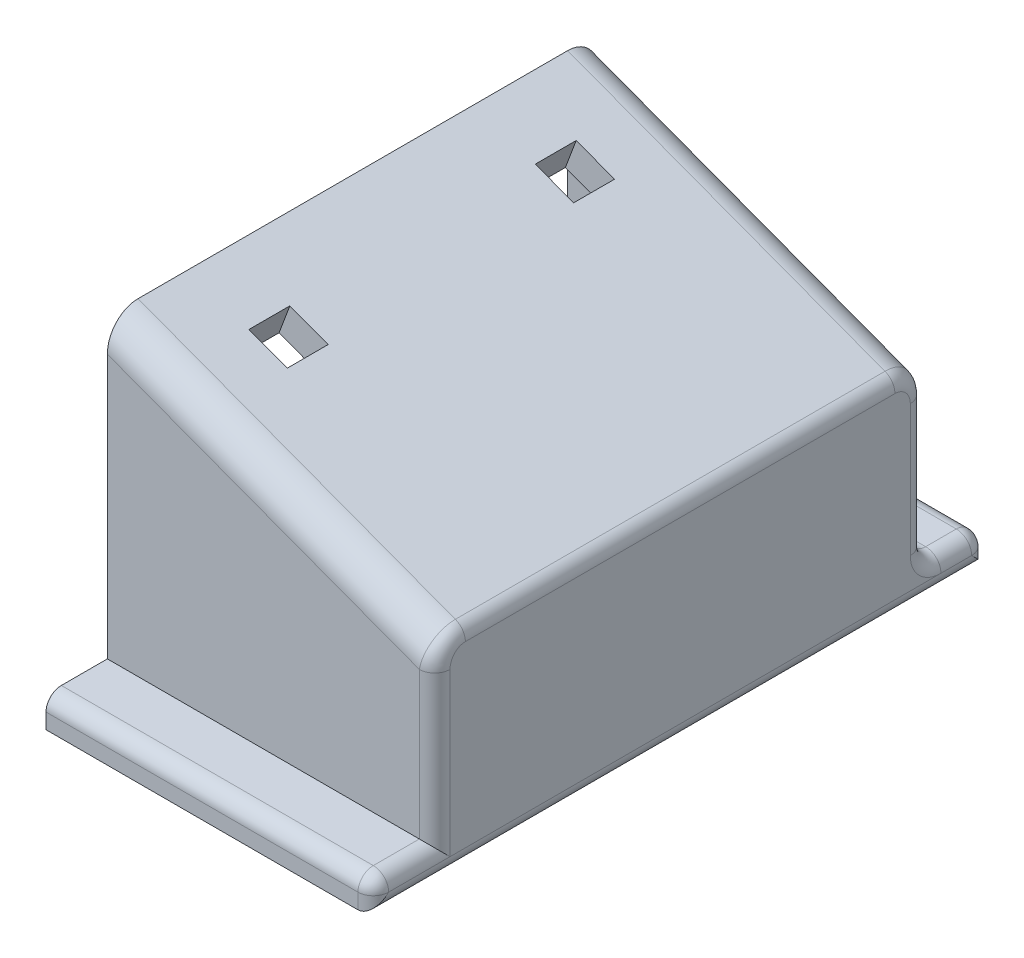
ISO-10303-21;
HEADER;
FILE_DESCRIPTION(('STEP AP214'),'2;1');
FILE_NAME('part.step','',(''),(''),'','','');
FILE_SCHEMA(('AUTOMOTIVE_DESIGN { 1 0 10303 214 1 1 1 1 }'));
ENDSEC;
DATA;
#1=APPLICATION_CONTEXT('core data for automotive mechanical design processes');
#2=APPLICATION_PROTOCOL_DEFINITION('international standard','automotive_design',2000,#1);
#3=PRODUCT_CONTEXT('',#1,'mechanical');
#4=PRODUCT('Part','Part','',(#3));
#5=PRODUCT_RELATED_PRODUCT_CATEGORY('part','',(#4));
#6=PRODUCT_DEFINITION_FORMATION('','',#4);
#7=PRODUCT_DEFINITION_CONTEXT('part definition',#1,'design');
#8=PRODUCT_DEFINITION('design','',#6,#7);
#9=PRODUCT_DEFINITION_SHAPE('','',#8);
#10=(LENGTH_UNIT() NAMED_UNIT(*) SI_UNIT(.MILLI.,.METRE.));
#11=(NAMED_UNIT(*) PLANE_ANGLE_UNIT() SI_UNIT($,.RADIAN.));
#12=(NAMED_UNIT(*) SI_UNIT($,.STERADIAN.) SOLID_ANGLE_UNIT());
#13=UNCERTAINTY_MEASURE_WITH_UNIT(LENGTH_MEASURE(1.E-05),#10,'distance_accuracy_value','');
#14=(GEOMETRIC_REPRESENTATION_CONTEXT(3) GLOBAL_UNCERTAINTY_ASSIGNED_CONTEXT((#13)) GLOBAL_UNIT_ASSIGNED_CONTEXT((#10,
#11,#12)) REPRESENTATION_CONTEXT('',''));
#15=CARTESIAN_POINT('',(0.,0.,0.));
#16=DIRECTION('',(0.,0.,1.));
#17=DIRECTION('',(1.,0.,0.));
#18=AXIS2_PLACEMENT_3D('',#15,#16,#17);
#19=CARTESIAN_POINT('',(0.,0.,-24.));
#20=DIRECTION('',(0.,0.,1.));
#21=DIRECTION('',(1.,0.,0.));
#22=AXIS2_PLACEMENT_3D('',#19,#20,#21);
#23=PLANE('',#22);
#24=DIRECTION('',(-0.936329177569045,0.351123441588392,0.));
#25=VECTOR('',#24,1.);
#26=CARTESIAN_POINT('',(9.4671776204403,25.2458069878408,-24.));
#27=LINE('',#26,#25);
#28=CARTESIAN_POINT('',(0.,28.7959985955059,-24.));
#29=VERTEX_POINT('',#28);
#30=CARTESIAN_POINT('',(30.5,17.3584985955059,-24.));
#31=VERTEX_POINT('',#30);
#32=EDGE_CURVE('E521',#29,#31,#27,.F.);
#33=ORIENTED_EDGE('',*,*,#32,.T.);
#34=DIRECTION('',(0.,1.,0.));
#35=VECTOR('',#34,1.);
#36=CARTESIAN_POINT('',(30.5,0.,-24.));
#37=LINE('',#36,#35);
#38=CARTESIAN_POINT('',(30.5,4.5,-24.));
#39=VERTEX_POINT('',#38);
#40=EDGE_CURVE('E276',#31,#39,#37,.F.);
#41=ORIENTED_EDGE('',*,*,#40,.T.);
#42=DIRECTION('',(1.,0.,0.));
#43=VECTOR('',#42,1.);
#44=CARTESIAN_POINT('',(0.,4.5,-24.));
#45=LINE('',#44,#43);
#46=CARTESIAN_POINT('',(0.,4.5,-24.));
#47=VERTEX_POINT('',#46);
#48=EDGE_CURVE('E269',#39,#47,#45,.F.);
#49=ORIENTED_EDGE('',*,*,#48,.T.);
#50=DIRECTION('',(0.,-1.,0.));
#51=VECTOR('',#50,1.);
#52=CARTESIAN_POINT('',(0.,32.,-24.));
#53=LINE('',#52,#51);
#54=EDGE_CURVE('E639',#29,#47,#53,.T.);
#55=ORIENTED_EDGE('',*,*,#54,.F.);
#56=EDGE_LOOP('',(#33,#41,#49,#55));
#57=FACE_BOUND('',#56,.T.);
#58=ADVANCED_FACE('F41',(#57),#23,.F.);
#59=CARTESIAN_POINT('',(0.,0.,24.));
#60=DIRECTION('',(0.,0.,1.));
#61=DIRECTION('',(1.,0.,0.));
#62=AXIS2_PLACEMENT_3D('',#59,#60,#61);
#63=PLANE('',#62);
#64=DIRECTION('',(1.,0.,0.));
#65=VECTOR('',#64,1.);
#66=CARTESIAN_POINT('',(0.,3.,24.));
#67=LINE('',#66,#65);
#68=CARTESIAN_POINT('',(0.,3.,24.));
#69=VERTEX_POINT('',#68);
#70=CARTESIAN_POINT('',(30.5,3.,24.));
#71=VERTEX_POINT('',#70);
#72=EDGE_CURVE('E678',#69,#71,#67,.T.);
#73=ORIENTED_EDGE('',*,*,#72,.T.);
#74=DIRECTION('',(0.,1.,0.));
#75=VECTOR('',#74,1.);
#76=CARTESIAN_POINT('',(30.5,16.7959985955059,24.));
#77=LINE('',#76,#75);
#78=CARTESIAN_POINT('',(30.5,17.3584985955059,24.));
#79=VERTEX_POINT('',#78);
#80=EDGE_CURVE('E510',#71,#79,#77,.T.);
#81=ORIENTED_EDGE('',*,*,#80,.T.);
#82=DIRECTION('',(-0.936329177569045,0.351123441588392,0.));
#83=VECTOR('',#82,1.);
#84=CARTESIAN_POINT('',(-1.05337032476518,29.1910124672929,24.));
#85=LINE('',#84,#83);
#86=CARTESIAN_POINT('',(0.,28.7959985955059,24.));
#87=VERTEX_POINT('',#86);
#88=EDGE_CURVE('E573',#79,#87,#85,.T.);
#89=ORIENTED_EDGE('',*,*,#88,.T.);
#90=DIRECTION('',(0.,-1.,0.));
#91=VECTOR('',#90,1.);
#92=CARTESIAN_POINT('',(0.,32.,24.));
#93=LINE('',#92,#91);
#94=EDGE_CURVE('E638',#87,#69,#93,.T.);
#95=ORIENTED_EDGE('',*,*,#94,.T.);
#96=EDGE_LOOP('',(#73,#81,#89,#95));
#97=FACE_BOUND('',#96,.T.);
#98=ADVANCED_FACE('F419',(#97),#63,.T.);
#99=CARTESIAN_POINT('',(0.,32.,24.));
#100=DIRECTION('',(1.,0.,0.));
#101=DIRECTION('',(0.,1.,0.));
#102=AXIS2_PLACEMENT_3D('',#99,#100,#101);
#103=PLANE('',#102);
#104=DIRECTION('',(0.,0.,1.));
#105=VECTOR('',#104,1.);
#106=CARTESIAN_POINT('',(0.,3.,-24.));
#107=LINE('',#106,#105);
#108=CARTESIAN_POINT('',(0.,3.,-28.5));
#109=VERTEX_POINT('',#108);
#110=CARTESIAN_POINT('',(0.,3.,-25.5));
#111=VERTEX_POINT('',#110);
#112=EDGE_CURVE('E283',#109,#111,#107,.T.);
#113=ORIENTED_EDGE('',*,*,#112,.F.);
#114=CARTESIAN_POINT('',(0.,1.5,-28.5));
#115=DIRECTION('',(1.,0.,0.));
#116=DIRECTION('',(0.,1.,0.));
#117=AXIS2_PLACEMENT_3D('',#114,#115,#116);
#118=CIRCLE('',#117,1.5);
#119=CARTESIAN_POINT('',(0.,1.5,-30.));
#120=VERTEX_POINT('',#119);
#121=EDGE_CURVE('E557',#109,#120,#118,.F.);
#122=ORIENTED_EDGE('',*,*,#121,.T.);
#123=DIRECTION('',(0.,-1.,0.));
#124=VECTOR('',#123,1.);
#125=CARTESIAN_POINT('',(0.,3.,-30.));
#126=LINE('',#125,#124);
#127=CARTESIAN_POINT('',(0.,0.,-30.));
#128=VERTEX_POINT('',#127);
#129=EDGE_CURVE('E683',#120,#128,#126,.T.);
#130=ORIENTED_EDGE('',*,*,#129,.T.);
#131=DIRECTION('',(0.,0.,-1.));
#132=VECTOR('',#131,1.);
#133=CARTESIAN_POINT('',(0.,0.,24.));
#134=LINE('',#133,#132);
#135=CARTESIAN_POINT('',(0.,0.,-21.));
#136=VERTEX_POINT('',#135);
#137=EDGE_CURVE('E635',#136,#128,#134,.T.);
#138=ORIENTED_EDGE('',*,*,#137,.F.);
#139=DIRECTION('',(0.,-1.,0.));
#140=VECTOR('',#139,1.);
#141=CARTESIAN_POINT('',(0.,32.,-21.));
#142=LINE('',#141,#140);
#143=CARTESIAN_POINT('',(0.,25.5919971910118,-21.));
#144=VERTEX_POINT('',#143);
#145=EDGE_CURVE('E650',#144,#136,#142,.T.);
#146=ORIENTED_EDGE('',*,*,#145,.F.);
#147=CARTESIAN_POINT('',(0.,25.5919971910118,-18.));
#148=DIRECTION('',(1.,0.,0.));
#149=DIRECTION('',(0.,-1.,0.));
#150=AXIS2_PLACEMENT_3D('',#147,#148,#149);
#151=ELLIPSE('',#150,3.20400140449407,3.);
#152=CARTESIAN_POINT('',(0.,28.7959985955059,-18.));
#153=VERTEX_POINT('',#152);
#154=EDGE_CURVE('E286',#144,#153,#151,.T.);
#155=ORIENTED_EDGE('',*,*,#154,.T.);
#156=DIRECTION('',(0.,0.,-1.));
#157=VECTOR('',#156,1.);
#158=CARTESIAN_POINT('',(0.,28.7959985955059,24.));
#159=LINE('',#158,#157);
#160=CARTESIAN_POINT('',(0.,28.7959985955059,18.));
#161=VERTEX_POINT('',#160);
#162=EDGE_CURVE('E654',#161,#153,#159,.T.);
#163=ORIENTED_EDGE('',*,*,#162,.F.);
#164=CARTESIAN_POINT('',(0.,25.5919971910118,18.));
#165=DIRECTION('',(1.,0.,0.));
#166=DIRECTION('',(0.,1.,0.));
#167=AXIS2_PLACEMENT_3D('',#164,#165,#166);
#168=ELLIPSE('',#167,3.20400140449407,3.);
#169=CARTESIAN_POINT('',(0.,25.5919971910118,21.));
#170=VERTEX_POINT('',#169);
#171=EDGE_CURVE('E570',#161,#170,#168,.T.);
#172=ORIENTED_EDGE('',*,*,#171,.T.);
#173=DIRECTION('',(0.,-1.,0.));
#174=VECTOR('',#173,1.);
#175=CARTESIAN_POINT('',(0.,32.,21.));
#176=LINE('',#175,#174);
#177=CARTESIAN_POINT('',(0.,1.5,21.));
#178=VERTEX_POINT('',#177);
#179=EDGE_CURVE('E660',#170,#178,#176,.T.);
#180=ORIENTED_EDGE('',*,*,#179,.T.);
#181=CARTESIAN_POINT('',(0.,1.5,22.5));
#182=DIRECTION('',(1.,0.,0.));
#183=DIRECTION('',(0.,1.,0.));
#184=AXIS2_PLACEMENT_3D('',#181,#182,#183);
#185=CIRCLE('',#184,1.5);
#186=CARTESIAN_POINT('',(0.,0.,22.5));
#187=VERTEX_POINT('',#186);
#188=EDGE_CURVE('E563',#178,#187,#185,.F.);
#189=ORIENTED_EDGE('',*,*,#188,.T.);
#190=CARTESIAN_POINT('',(0.,0.,30.));
#191=VERTEX_POINT('',#190);
#192=EDGE_CURVE('E631',#191,#187,#134,.T.);
#193=ORIENTED_EDGE('',*,*,#192,.F.);
#194=DIRECTION('',(0.,-1.,0.));
#195=VECTOR('',#194,1.);
#196=CARTESIAN_POINT('',(0.,3.,30.));
#197=LINE('',#196,#195);
#198=CARTESIAN_POINT('',(0.,1.5,30.));
#199=VERTEX_POINT('',#198);
#200=EDGE_CURVE('E653',#199,#191,#197,.T.);
#201=ORIENTED_EDGE('',*,*,#200,.F.);
#202=CARTESIAN_POINT('',(0.,1.5,28.5));
#203=DIRECTION('',(1.,0.,0.));
#204=DIRECTION('',(0.,1.,0.));
#205=AXIS2_PLACEMENT_3D('',#202,#203,#204);
#206=CIRCLE('',#205,1.5);
#207=CARTESIAN_POINT('',(0.,3.,28.5));
#208=VERTEX_POINT('',#207);
#209=EDGE_CURVE('E560',#199,#208,#206,.F.);
#210=ORIENTED_EDGE('',*,*,#209,.T.);
#211=DIRECTION('',(0.,0.,-1.));
#212=VECTOR('',#211,1.);
#213=CARTESIAN_POINT('',(0.,3.,24.));
#214=LINE('',#213,#212);
#215=EDGE_CURVE('E682',#208,#69,#214,.T.);
#216=ORIENTED_EDGE('',*,*,#215,.T.);
#217=ORIENTED_EDGE('',*,*,#94,.F.);
#218=CARTESIAN_POINT('',(0.,28.7959985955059,21.));
#219=DIRECTION('',(1.,0.,0.));
#220=DIRECTION('',(0.,-1.,0.));
#221=AXIS2_PLACEMENT_3D('',#218,#219,#220);
#222=ELLIPSE('',#221,3.20400140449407,3.);
#223=CARTESIAN_POINT('',(0.,32.,21.));
#224=VERTEX_POINT('',#223);
#225=EDGE_CURVE('E581',#87,#224,#222,.F.);
#226=ORIENTED_EDGE('',*,*,#225,.T.);
#227=DIRECTION('',(0.,0.,-1.));
#228=VECTOR('',#227,1.);
#229=CARTESIAN_POINT('',(0.,32.,24.));
#230=LINE('',#229,#228);
#231=CARTESIAN_POINT('',(0.,32.,-21.));
#232=VERTEX_POINT('',#231);
#233=EDGE_CURVE('E462',#224,#232,#230,.T.);
#234=ORIENTED_EDGE('',*,*,#233,.T.);
#235=CARTESIAN_POINT('',(0.,28.7959985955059,-21.));
#236=DIRECTION('',(1.,0.,0.));
#237=DIRECTION('',(0.,1.,0.));
#238=AXIS2_PLACEMENT_3D('',#235,#236,#237);
#239=ELLIPSE('',#238,3.20400140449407,3.);
#240=EDGE_CURVE('E578',#232,#29,#239,.F.);
#241=ORIENTED_EDGE('',*,*,#240,.T.);
#242=ORIENTED_EDGE('',*,*,#54,.T.);
#243=CARTESIAN_POINT('',(0.,4.5,-25.5));
#244=DIRECTION('',(1.,0.,0.));
#245=DIRECTION('',(0.,1.,0.));
#246=AXIS2_PLACEMENT_3D('',#243,#244,#245);
#247=CIRCLE('',#246,1.5);
#248=EDGE_CURVE('E535',#47,#111,#247,.T.);
#249=ORIENTED_EDGE('',*,*,#248,.T.);
#250=EDGE_LOOP('',(#113,#122,#130,#138,#146,#155,#163,#172,#180,#189,#193,#201,#210,#216,#217,
#226,#234,#241,#242,#249));
#251=FACE_BOUND('',#250,.T.);
#252=ADVANCED_FACE('F425',(#251),#103,.F.);
#253=CARTESIAN_POINT('',(0.,0.,24.));
#254=DIRECTION('',(0.,1.,0.));
#255=DIRECTION('',(0.,0.,1.));
#256=AXIS2_PLACEMENT_3D('',#253,#254,#255);
#257=PLANE('',#256);
#258=DIRECTION('',(-1.,0.,0.));
#259=VECTOR('',#258,1.);
#260=CARTESIAN_POINT('',(0.,0.,-30.));
#261=LINE('',#260,#259);
#262=CARTESIAN_POINT('',(30.5,0.,-30.));
#263=VERTEX_POINT('',#262);
#264=EDGE_CURVE('E692',#263,#128,#261,.T.);
#265=ORIENTED_EDGE('',*,*,#264,.F.);
#266=DIRECTION('',(0.,0.,-1.));
#267=VECTOR('',#266,1.);
#268=CARTESIAN_POINT('',(30.5,0.,24.));
#269=LINE('',#268,#267);
#270=CARTESIAN_POINT('',(30.5,0.,30.));
#271=VERTEX_POINT('',#270);
#272=EDGE_CURVE('E497',#263,#271,#269,.F.);
#273=ORIENTED_EDGE('',*,*,#272,.T.);
#274=DIRECTION('',(-1.,0.,0.));
#275=VECTOR('',#274,1.);
#276=CARTESIAN_POINT('',(0.,0.,30.));
#277=LINE('',#276,#275);
#278=EDGE_CURVE('E679',#271,#191,#277,.T.);
#279=ORIENTED_EDGE('',*,*,#278,.T.);
#280=ORIENTED_EDGE('',*,*,#192,.T.);
#281=DIRECTION('',(1.,0.,0.));
#282=VECTOR('',#281,1.);
#283=CARTESIAN_POINT('',(0.,0.,22.5));
#284=LINE('',#283,#282);
#285=CARTESIAN_POINT('',(29.,0.,22.5));
#286=VERTEX_POINT('',#285);
#287=EDGE_CURVE('E541',#187,#286,#284,.T.);
#288=ORIENTED_EDGE('',*,*,#287,.T.);
#289=DIRECTION('',(0.,0.,-1.));
#290=VECTOR('',#289,1.);
#291=CARTESIAN_POINT('',(29.,0.,24.));
#292=LINE('',#291,#290);
#293=CARTESIAN_POINT('',(29.,0.,-21.));
#294=VERTEX_POINT('',#293);
#295=EDGE_CURVE('E642',#286,#294,#292,.T.);
#296=ORIENTED_EDGE('',*,*,#295,.T.);
#297=DIRECTION('',(1.,0.,0.));
#298=VECTOR('',#297,1.);
#299=CARTESIAN_POINT('',(0.,0.,-21.));
#300=LINE('',#299,#298);
#301=EDGE_CURVE('E646',#136,#294,#300,.T.);
#302=ORIENTED_EDGE('',*,*,#301,.F.);
#303=ORIENTED_EDGE('',*,*,#137,.T.);
#304=EDGE_LOOP('',(#265,#273,#279,#280,#288,#296,#302,#303));
#305=FACE_BOUND('',#304,.T.);
#306=ADVANCED_FACE('F441',(#305),#257,.F.);
#307=CARTESIAN_POINT('',(32.,0.,24.));
#308=DIRECTION('',(-1.,0.,0.));
#309=DIRECTION('',(0.,-1.,0.));
#310=AXIS2_PLACEMENT_3D('',#307,#308,#309);
#311=PLANE('',#310);
#312=DIRECTION('',(0.,1.,0.));
#313=VECTOR('',#312,1.);
#314=CARTESIAN_POINT('',(32.,3.,22.5));
#315=LINE('',#314,#313);
#316=CARTESIAN_POINT('',(32.,17.3584985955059,22.5));
#317=VERTEX_POINT('',#316);
#318=CARTESIAN_POINT('',(32.,1.5,22.5));
#319=VERTEX_POINT('',#318);
#320=EDGE_CURVE('E484',#317,#319,#315,.F.);
#321=ORIENTED_EDGE('',*,*,#320,.T.);
#322=DIRECTION('',(0.,0.,-1.));
#323=VECTOR('',#322,1.);
#324=CARTESIAN_POINT('',(32.,1.5,24.));
#325=LINE('',#324,#323);
#326=CARTESIAN_POINT('',(32.,1.5,-25.5));
#327=VERTEX_POINT('',#326);
#328=EDGE_CURVE('E489',#319,#327,#325,.T.);
#329=ORIENTED_EDGE('',*,*,#328,.T.);
#330=CARTESIAN_POINT('',(32.,4.5,-25.5));
#331=DIRECTION('',(-1.,0.,0.));
#332=DIRECTION('',(0.,-1.,0.));
#333=AXIS2_PLACEMENT_3D('',#330,#331,#332);
#334=CIRCLE('',#333,3.);
#335=CARTESIAN_POINT('',(32.,4.5,-22.5));
#336=VERTEX_POINT('',#335);
#337=EDGE_CURVE('E292',#327,#336,#334,.T.);
#338=ORIENTED_EDGE('',*,*,#337,.T.);
#339=DIRECTION('',(0.,1.,0.));
#340=VECTOR('',#339,1.);
#341=CARTESIAN_POINT('',(32.,0.,-22.5));
#342=LINE('',#341,#340);
#343=CARTESIAN_POINT('',(32.,17.3584985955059,-22.5));
#344=VERTEX_POINT('',#343);
#345=EDGE_CURVE('E524',#336,#344,#342,.T.);
#346=ORIENTED_EDGE('',*,*,#345,.T.);
#347=CARTESIAN_POINT('',(32.,17.3584985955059,-21.));
#348=DIRECTION('',(-1.,0.,0.));
#349=DIRECTION('',(0.,1.,0.));
#350=AXIS2_PLACEMENT_3D('',#347,#348,#349);
#351=ELLIPSE('',#350,1.60200070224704,1.5);
#352=CARTESIAN_POINT('',(32.,18.960499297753,-21.));
#353=VERTEX_POINT('',#352);
#354=EDGE_CURVE('E491',#344,#353,#351,.F.);
#355=ORIENTED_EDGE('',*,*,#354,.T.);
#356=DIRECTION('',(0.,0.,-1.));
#357=VECTOR('',#356,1.);
#358=CARTESIAN_POINT('',(32.,18.960499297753,24.));
#359=LINE('',#358,#357);
#360=CARTESIAN_POINT('',(32.,18.960499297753,21.));
#361=VERTEX_POINT('',#360);
#362=EDGE_CURVE('E485',#353,#361,#359,.F.);
#363=ORIENTED_EDGE('',*,*,#362,.T.);
#364=CARTESIAN_POINT('',(32.,17.3584985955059,21.));
#365=DIRECTION('',(-1.,0.,0.));
#366=DIRECTION('',(0.,-1.,0.));
#367=AXIS2_PLACEMENT_3D('',#364,#365,#366);
#368=ELLIPSE('',#367,1.60200070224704,1.5);
#369=EDGE_CURVE('E481',#361,#317,#368,.F.);
#370=ORIENTED_EDGE('',*,*,#369,.T.);
#371=EDGE_LOOP('',(#321,#329,#338,#346,#355,#363,#370));
#372=FACE_BOUND('',#371,.T.);
#373=ADVANCED_FACE('F361',(#372),#311,.F.);
#374=CARTESIAN_POINT('',(32.,20.,24.));
#375=DIRECTION('',(-0.351123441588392,-0.936329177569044,0.));
#376=DIRECTION('',(0.936329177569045,-0.351123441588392,0.));
#377=AXIS2_PLACEMENT_3D('',#374,#375,#376);
#378=PLANE('',#377);
#379=DIRECTION('',(-0.936329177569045,0.351123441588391,0.));
#380=VECTOR('',#379,1.);
#381=CARTESIAN_POINT('',(5.83890205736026,29.8104117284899,-16.));
#382=LINE('',#381,#380);
#383=CARTESIAN_POINT('',(9.58421876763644,28.4059179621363,-16.));
#384=VERTEX_POINT('',#383);
#385=CARTESIAN_POINT('',(5.83890205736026,29.8104117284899,-16.));
#386=VERTEX_POINT('',#385);
#387=EDGE_CURVE('E448',#384,#386,#382,.T.);
#388=ORIENTED_EDGE('',*,*,#387,.F.);
#389=DIRECTION('',(0.,0.,-1.));
#390=VECTOR('',#389,1.);
#391=CARTESIAN_POINT('',(9.58421876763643,28.4059179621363,-12.));
#392=LINE('',#391,#390);
#393=CARTESIAN_POINT('',(9.58421876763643,28.4059179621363,-12.));
#394=VERTEX_POINT('',#393);
#395=EDGE_CURVE('E711',#394,#384,#392,.T.);
#396=ORIENTED_EDGE('',*,*,#395,.F.);
#397=DIRECTION('',(0.936329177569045,-0.351123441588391,0.));
#398=VECTOR('',#397,1.);
#399=CARTESIAN_POINT('',(5.83890205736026,29.8104117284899,-12.));
#400=LINE('',#399,#398);
#401=CARTESIAN_POINT('',(5.83890205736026,29.8104117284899,-12.));
#402=VERTEX_POINT('',#401);
#403=EDGE_CURVE('E728',#402,#394,#400,.T.);
#404=ORIENTED_EDGE('',*,*,#403,.F.);
#405=DIRECTION('',(0.,0.,1.));
#406=VECTOR('',#405,1.);
#407=CARTESIAN_POINT('',(5.83890205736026,29.8104117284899,-12.));
#408=LINE('',#407,#406);
#409=EDGE_CURVE('E742',#386,#402,#408,.T.);
#410=ORIENTED_EDGE('',*,*,#409,.F.);
#411=EDGE_LOOP('',(#388,#396,#404,#410));
#412=FACE_BOUND('',#411,.T.);
#413=DIRECTION('',(0.936329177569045,-0.351123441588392,0.));
#414=VECTOR('',#413,1.);
#415=CARTESIAN_POINT('',(5.83890205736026,29.8104117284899,16.));
#416=LINE('',#415,#414);
#417=CARTESIAN_POINT('',(5.83890205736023,29.8104117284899,16.));
#418=VERTEX_POINT('',#417);
#419=CARTESIAN_POINT('',(9.58421876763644,28.4059179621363,16.));
#420=VERTEX_POINT('',#419);
#421=EDGE_CURVE('E453',#418,#420,#416,.T.);
#422=ORIENTED_EDGE('',*,*,#421,.F.);
#423=DIRECTION('',(0.,0.,1.));
#424=VECTOR('',#423,1.);
#425=CARTESIAN_POINT('',(5.83890205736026,29.8104117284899,12.));
#426=LINE('',#425,#424);
#427=CARTESIAN_POINT('',(5.83890205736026,29.8104117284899,12.));
#428=VERTEX_POINT('',#427);
#429=EDGE_CURVE('E720',#428,#418,#426,.T.);
#430=ORIENTED_EDGE('',*,*,#429,.F.);
#431=DIRECTION('',(-0.936329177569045,0.351123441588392,0.));
#432=VECTOR('',#431,1.);
#433=CARTESIAN_POINT('',(5.83890205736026,29.8104117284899,12.));
#434=LINE('',#433,#432);
#435=CARTESIAN_POINT('',(9.58421876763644,28.4059179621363,12.));
#436=VERTEX_POINT('',#435);
#437=EDGE_CURVE('E702',#436,#428,#434,.T.);
#438=ORIENTED_EDGE('',*,*,#437,.F.);
#439=DIRECTION('',(0.,0.,-1.));
#440=VECTOR('',#439,1.);
#441=CARTESIAN_POINT('',(9.58421876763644,28.4059179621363,12.));
#442=LINE('',#441,#440);
#443=EDGE_CURVE('E715',#420,#436,#442,.T.);
#444=ORIENTED_EDGE('',*,*,#443,.F.);
#445=EDGE_LOOP('',(#422,#430,#438,#444));
#446=FACE_BOUND('',#445,.T.);
#447=DIRECTION('',(-0.936329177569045,0.351123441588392,0.));
#448=VECTOR('',#447,1.);
#449=CARTESIAN_POINT('',(32.,20.,21.));
#450=LINE('',#449,#448);
#451=CARTESIAN_POINT('',(31.0266851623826,20.3649930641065,21.));
#452=VERTEX_POINT('',#451);
#453=EDGE_CURVE('E457',#224,#452,#450,.F.);
#454=ORIENTED_EDGE('',*,*,#453,.T.);
#455=DIRECTION('',(0.,0.,-1.));
#456=VECTOR('',#455,1.);
#457=CARTESIAN_POINT('',(31.0266851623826,20.3649930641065,24.));
#458=LINE('',#457,#456);
#459=CARTESIAN_POINT('',(31.0266851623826,20.3649930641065,-21.));
#460=VERTEX_POINT('',#459);
#461=EDGE_CURVE('E459',#452,#460,#458,.T.);
#462=ORIENTED_EDGE('',*,*,#461,.T.);
#463=DIRECTION('',(-0.936329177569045,0.351123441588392,0.));
#464=VECTOR('',#463,1.);
#465=CARTESIAN_POINT('',(32.,20.,-21.));
#466=LINE('',#465,#464);
#467=EDGE_CURVE('E465',#460,#232,#466,.T.);
#468=ORIENTED_EDGE('',*,*,#467,.T.);
#469=ORIENTED_EDGE('',*,*,#233,.F.);
#470=EDGE_LOOP('',(#454,#462,#468,#469));
#471=FACE_BOUND('',#470,.T.);
#472=ADVANCED_FACE('F430',(#412,#446,#471),#378,.F.);
#473=CARTESIAN_POINT('',(29.,0.,24.));
#474=DIRECTION('',(-1.,0.,0.));
#475=DIRECTION('',(0.,-1.,0.));
#476=AXIS2_PLACEMENT_3D('',#473,#474,#475);
#477=PLANE('',#476);
#478=ORIENTED_EDGE('',*,*,#295,.F.);
#479=CARTESIAN_POINT('',(29.,1.5,22.5));
#480=DIRECTION('',(-1.,0.,0.));
#481=DIRECTION('',(0.,-1.,0.));
#482=AXIS2_PLACEMENT_3D('',#479,#480,#481);
#483=CIRCLE('',#482,1.5);
#484=CARTESIAN_POINT('',(29.,1.5,21.));
#485=VERTEX_POINT('',#484);
#486=EDGE_CURVE('E530',#286,#485,#483,.F.);
#487=ORIENTED_EDGE('',*,*,#486,.T.);
#488=DIRECTION('',(0.,1.,0.));
#489=VECTOR('',#488,1.);
#490=CARTESIAN_POINT('',(29.,0.,21.));
#491=LINE('',#490,#489);
#492=CARTESIAN_POINT('',(29.,14.7169971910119,21.));
#493=VERTEX_POINT('',#492);
#494=EDGE_CURVE('E659',#485,#493,#491,.T.);
#495=ORIENTED_EDGE('',*,*,#494,.T.);
#496=CARTESIAN_POINT('',(29.,14.7169971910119,18.));
#497=DIRECTION('',(-1.,0.,0.));
#498=DIRECTION('',(0.,1.,0.));
#499=AXIS2_PLACEMENT_3D('',#496,#497,#498);
#500=ELLIPSE('',#499,3.20400140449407,3.);
#501=CARTESIAN_POINT('',(29.,17.9209985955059,18.));
#502=VERTEX_POINT('',#501);
#503=EDGE_CURVE('E589',#493,#502,#500,.T.);
#504=ORIENTED_EDGE('',*,*,#503,.T.);
#505=DIRECTION('',(0.,0.,-1.));
#506=VECTOR('',#505,1.);
#507=CARTESIAN_POINT('',(29.,17.9209985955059,24.));
#508=LINE('',#507,#506);
#509=CARTESIAN_POINT('',(29.,17.9209985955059,-18.));
#510=VERTEX_POINT('',#509);
#511=EDGE_CURVE('E658',#502,#510,#508,.T.);
#512=ORIENTED_EDGE('',*,*,#511,.T.);
#513=CARTESIAN_POINT('',(29.,14.7169971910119,-18.));
#514=DIRECTION('',(-1.,0.,0.));
#515=DIRECTION('',(0.,-1.,0.));
#516=AXIS2_PLACEMENT_3D('',#513,#514,#515);
#517=ELLIPSE('',#516,3.20400140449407,3.);
#518=CARTESIAN_POINT('',(29.,14.7169971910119,-21.));
#519=VERTEX_POINT('',#518);
#520=EDGE_CURVE('E592',#510,#519,#517,.T.);
#521=ORIENTED_EDGE('',*,*,#520,.T.);
#522=DIRECTION('',(0.,1.,0.));
#523=VECTOR('',#522,1.);
#524=CARTESIAN_POINT('',(29.,0.,-21.));
#525=LINE('',#524,#523);
#526=EDGE_CURVE('E649',#294,#519,#525,.T.);
#527=ORIENTED_EDGE('',*,*,#526,.F.);
#528=EDGE_LOOP('',(#478,#487,#495,#504,#512,#521,#527));
#529=FACE_BOUND('',#528,.T.);
#530=ADVANCED_FACE('F432',(#529),#477,.T.);
#531=CARTESIAN_POINT('',(30.9466296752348,17.1910124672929,24.));
#532=DIRECTION('',(-0.351123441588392,-0.936329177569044,0.));
#533=DIRECTION('',(0.936329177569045,-0.351123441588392,0.));
#534=AXIS2_PLACEMENT_3D('',#531,#532,#533);
#535=PLANE('',#534);
#536=DIRECTION('',(0.,0.,1.));
#537=VECTOR('',#536,1.);
#538=CARTESIAN_POINT('',(8.53084844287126,25.5969304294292,24.));
#539=LINE('',#538,#537);
#540=CARTESIAN_POINT('',(8.53084844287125,25.5969304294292,-16.));
#541=VERTEX_POINT('',#540);
#542=CARTESIAN_POINT('',(8.53084844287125,25.5969304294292,-12.));
#543=VERTEX_POINT('',#542);
#544=EDGE_CURVE('E606',#541,#543,#539,.T.);
#545=ORIENTED_EDGE('',*,*,#544,.F.);
#546=DIRECTION('',(0.936329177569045,-0.351123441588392,0.));
#547=VECTOR('',#546,1.);
#548=CARTESIAN_POINT('',(30.9466296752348,17.1910124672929,-16.));
#549=LINE('',#548,#547);
#550=CARTESIAN_POINT('',(4.78553173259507,27.0014241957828,-16.));
#551=VERTEX_POINT('',#550);
#552=EDGE_CURVE('E616',#551,#541,#549,.T.);
#553=ORIENTED_EDGE('',*,*,#552,.F.);
#554=DIRECTION('',(0.,0.,-1.));
#555=VECTOR('',#554,1.);
#556=CARTESIAN_POINT('',(4.78553173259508,27.0014241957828,24.));
#557=LINE('',#556,#555);
#558=CARTESIAN_POINT('',(4.78553173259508,27.0014241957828,-12.));
#559=VERTEX_POINT('',#558);
#560=EDGE_CURVE('E612',#559,#551,#557,.T.);
#561=ORIENTED_EDGE('',*,*,#560,.F.);
#562=DIRECTION('',(-0.936329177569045,0.351123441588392,0.));
#563=VECTOR('',#562,1.);
#564=CARTESIAN_POINT('',(30.9466296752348,17.1910124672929,-12.));
#565=LINE('',#564,#563);
#566=EDGE_CURVE('E609',#543,#559,#565,.T.);
#567=ORIENTED_EDGE('',*,*,#566,.F.);
#568=EDGE_LOOP('',(#545,#553,#561,#567));
#569=FACE_BOUND('',#568,.T.);
#570=DIRECTION('',(0.,0.,-1.));
#571=VECTOR('',#570,1.);
#572=CARTESIAN_POINT('',(4.78553173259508,27.0014241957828,24.));
#573=LINE('',#572,#571);
#574=CARTESIAN_POINT('',(4.78553173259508,27.0014241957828,16.));
#575=VERTEX_POINT('',#574);
#576=CARTESIAN_POINT('',(4.78553173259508,27.0014241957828,12.));
#577=VERTEX_POINT('',#576);
#578=EDGE_CURVE('E619',#575,#577,#573,.T.);
#579=ORIENTED_EDGE('',*,*,#578,.F.);
#580=DIRECTION('',(-0.936329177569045,0.351123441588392,0.));
#581=VECTOR('',#580,1.);
#582=CARTESIAN_POINT('',(30.9466296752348,17.1910124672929,16.));
#583=LINE('',#582,#581);
#584=CARTESIAN_POINT('',(8.53084844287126,25.5969304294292,16.));
#585=VERTEX_POINT('',#584);
#586=EDGE_CURVE('E628',#585,#575,#583,.T.);
#587=ORIENTED_EDGE('',*,*,#586,.F.);
#588=DIRECTION('',(0.,0.,1.));
#589=VECTOR('',#588,1.);
#590=CARTESIAN_POINT('',(8.53084844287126,25.5969304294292,24.));
#591=LINE('',#590,#589);
#592=CARTESIAN_POINT('',(8.53084844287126,25.5969304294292,12.));
#593=VERTEX_POINT('',#592);
#594=EDGE_CURVE('E625',#593,#585,#591,.T.);
#595=ORIENTED_EDGE('',*,*,#594,.F.);
#596=DIRECTION('',(0.936329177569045,-0.351123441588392,0.));
#597=VECTOR('',#596,1.);
#598=CARTESIAN_POINT('',(30.9466296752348,17.1910124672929,12.));
#599=LINE('',#598,#597);
#600=EDGE_CURVE('E622',#577,#593,#599,.T.);
#601=ORIENTED_EDGE('',*,*,#600,.F.);
#602=EDGE_LOOP('',(#579,#587,#595,#601));
#603=FACE_BOUND('',#602,.T.);
#604=ORIENTED_EDGE('',*,*,#511,.F.);
#605=DIRECTION('',(-0.936329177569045,0.351123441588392,0.));
#606=VECTOR('',#605,1.);
#607=CARTESIAN_POINT('',(30.9466296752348,17.1910124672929,18.));
#608=LINE('',#607,#606);
#609=EDGE_CURVE('E599',#502,#161,#608,.T.);
#610=ORIENTED_EDGE('',*,*,#609,.T.);
#611=ORIENTED_EDGE('',*,*,#162,.T.);
#612=DIRECTION('',(-0.936329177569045,0.351123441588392,0.));
#613=VECTOR('',#612,1.);
#614=CARTESIAN_POINT('',(29.,17.9209985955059,-18.));
#615=LINE('',#614,#613);
#616=EDGE_CURVE('E603',#153,#510,#615,.F.);
#617=ORIENTED_EDGE('',*,*,#616,.T.);
#618=EDGE_LOOP('',(#604,#610,#611,#617));
#619=FACE_BOUND('',#618,.T.);
#620=ADVANCED_FACE('F438',(#569,#603,#619),#535,.T.);
#621=CARTESIAN_POINT('',(0.,0.,21.));
#622=DIRECTION('',(0.,0.,1.));
#623=DIRECTION('',(1.,0.,0.));
#624=AXIS2_PLACEMENT_3D('',#621,#622,#623);
#625=PLANE('',#624);
#626=ORIENTED_EDGE('',*,*,#494,.F.);
#627=DIRECTION('',(1.,0.,0.));
#628=VECTOR('',#627,1.);
#629=CARTESIAN_POINT('',(0.,1.5,21.));
#630=LINE('',#629,#628);
#631=EDGE_CURVE('E538',#485,#178,#630,.F.);
#632=ORIENTED_EDGE('',*,*,#631,.T.);
#633=ORIENTED_EDGE('',*,*,#179,.F.);
#634=DIRECTION('',(-0.936329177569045,0.351123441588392,0.));
#635=VECTOR('',#634,1.);
#636=CARTESIAN_POINT('',(8.41380729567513,22.4368194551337,21.));
#637=LINE('',#636,#635);
#638=EDGE_CURVE('E595',#170,#493,#637,.F.);
#639=ORIENTED_EDGE('',*,*,#638,.T.);
#640=EDGE_LOOP('',(#626,#632,#633,#639));
#641=FACE_BOUND('',#640,.T.);
#642=ADVANCED_FACE('F813',(#641),#625,.F.);
#643=CARTESIAN_POINT('',(0.,0.,-21.));
#644=DIRECTION('',(0.,0.,1.));
#645=DIRECTION('',(1.,0.,0.));
#646=AXIS2_PLACEMENT_3D('',#643,#644,#645);
#647=PLANE('',#646);
#648=ORIENTED_EDGE('',*,*,#526,.T.);
#649=DIRECTION('',(-0.936329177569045,0.351123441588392,0.));
#650=VECTOR('',#649,1.);
#651=CARTESIAN_POINT('',(-1.05337032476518,25.9870110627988,-21.));
#652=LINE('',#651,#650);
#653=EDGE_CURVE('E466',#519,#144,#652,.T.);
#654=ORIENTED_EDGE('',*,*,#653,.T.);
#655=ORIENTED_EDGE('',*,*,#145,.T.);
#656=ORIENTED_EDGE('',*,*,#301,.T.);
#657=EDGE_LOOP('',(#648,#654,#655,#656));
#658=FACE_BOUND('',#657,.T.);
#659=ADVANCED_FACE('F808',(#658),#647,.T.);
#660=CARTESIAN_POINT('',(0.,3.,30.));
#661=DIRECTION('',(0.,0.,1.));
#662=DIRECTION('',(1.,0.,0.));
#663=AXIS2_PLACEMENT_3D('',#660,#661,#662);
#664=PLANE('',#663);
#665=ORIENTED_EDGE('',*,*,#278,.F.);
#666=DIRECTION('',(0.,-1.,0.));
#667=VECTOR('',#666,1.);
#668=CARTESIAN_POINT('',(30.5,1.5,30.));
#669=LINE('',#668,#667);
#670=CARTESIAN_POINT('',(30.5,1.5,30.));
#671=VERTEX_POINT('',#670);
#672=EDGE_CURVE('E501',#271,#671,#669,.F.);
#673=ORIENTED_EDGE('',*,*,#672,.T.);
#674=DIRECTION('',(-1.,0.,0.));
#675=VECTOR('',#674,1.);
#676=CARTESIAN_POINT('',(0.,1.5,30.));
#677=LINE('',#676,#675);
#678=EDGE_CURVE('E549',#671,#199,#677,.T.);
#679=ORIENTED_EDGE('',*,*,#678,.T.);
#680=ORIENTED_EDGE('',*,*,#200,.T.);
#681=EDGE_LOOP('',(#665,#673,#679,#680));
#682=FACE_BOUND('',#681,.T.);
#683=ADVANCED_FACE('F805',(#682),#664,.T.);
#684=CARTESIAN_POINT('',(0.,3.,0.));
#685=DIRECTION('',(0.,1.,0.));
#686=DIRECTION('',(0.,0.,1.));
#687=AXIS2_PLACEMENT_3D('',#684,#685,#686);
#688=PLANE('',#687);
#689=DIRECTION('',(-1.,0.,0.));
#690=VECTOR('',#689,1.);
#691=CARTESIAN_POINT('',(0.,3.,28.5));
#692=LINE('',#691,#690);
#693=CARTESIAN_POINT('',(30.5,3.,28.5));
#694=VERTEX_POINT('',#693);
#695=EDGE_CURVE('E545',#208,#694,#692,.F.);
#696=ORIENTED_EDGE('',*,*,#695,.T.);
#697=DIRECTION('',(0.,0.,1.));
#698=VECTOR('',#697,1.);
#699=CARTESIAN_POINT('',(30.5,3.,24.));
#700=LINE('',#699,#698);
#701=EDGE_CURVE('E507',#694,#71,#700,.F.);
#702=ORIENTED_EDGE('',*,*,#701,.T.);
#703=ORIENTED_EDGE('',*,*,#72,.F.);
#704=ORIENTED_EDGE('',*,*,#215,.F.);
#705=EDGE_LOOP('',(#696,#702,#703,#704));
#706=FACE_BOUND('',#705,.T.);
#707=ADVANCED_FACE('F801',(#706),#688,.T.);
#708=CARTESIAN_POINT('',(0.,3.,-30.));
#709=DIRECTION('',(0.,0.,1.));
#710=DIRECTION('',(1.,0.,0.));
#711=AXIS2_PLACEMENT_3D('',#708,#709,#710);
#712=PLANE('',#711);
#713=DIRECTION('',(-1.,0.,0.));
#714=VECTOR('',#713,1.);
#715=CARTESIAN_POINT('',(32.,1.5,-30.));
#716=LINE('',#715,#714);
#717=CARTESIAN_POINT('',(30.5,1.5,-30.));
#718=VERTEX_POINT('',#717);
#719=EDGE_CURVE('E554',#120,#718,#716,.F.);
#720=ORIENTED_EDGE('',*,*,#719,.T.);
#721=DIRECTION('',(0.,-1.,0.));
#722=VECTOR('',#721,1.);
#723=CARTESIAN_POINT('',(30.5,2.99999999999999,-30.));
#724=LINE('',#723,#722);
#725=EDGE_CURVE('E11',#718,#263,#724,.T.);
#726=ORIENTED_EDGE('',*,*,#725,.T.);
#727=ORIENTED_EDGE('',*,*,#264,.T.);
#728=ORIENTED_EDGE('',*,*,#129,.F.);
#729=EDGE_LOOP('',(#720,#726,#727,#728));
#730=FACE_BOUND('',#729,.T.);
#731=ADVANCED_FACE('F798',(#730),#712,.F.);
#732=CARTESIAN_POINT('',(0.,3.,0.));
#733=DIRECTION('',(0.,1.,0.));
#734=DIRECTION('',(0.,0.,-1.));
#735=AXIS2_PLACEMENT_3D('',#732,#733,#734);
#736=PLANE('',#735);
#737=DIRECTION('',(1.,0.,0.));
#738=VECTOR('',#737,1.);
#739=CARTESIAN_POINT('',(0.,3.,-25.5));
#740=LINE('',#739,#738);
#741=CARTESIAN_POINT('',(30.5,3.,-25.5));
#742=VERTEX_POINT('',#741);
#743=EDGE_CURVE('E268',#111,#742,#740,.T.);
#744=ORIENTED_EDGE('',*,*,#743,.T.);
#745=DIRECTION('',(0.,0.,-1.));
#746=VECTOR('',#745,1.);
#747=CARTESIAN_POINT('',(30.5,3.,-28.5));
#748=LINE('',#747,#746);
#749=CARTESIAN_POINT('',(30.5,3.,-28.5));
#750=VERTEX_POINT('',#749);
#751=EDGE_CURVE('E275',#742,#750,#748,.T.);
#752=ORIENTED_EDGE('',*,*,#751,.T.);
#753=DIRECTION('',(-1.,0.,0.));
#754=VECTOR('',#753,1.);
#755=CARTESIAN_POINT('',(0.,3.,-28.5));
#756=LINE('',#755,#754);
#757=EDGE_CURVE('E285',#750,#109,#756,.T.);
#758=ORIENTED_EDGE('',*,*,#757,.T.);
#759=ORIENTED_EDGE('',*,*,#112,.T.);
#760=EDGE_LOOP('',(#744,#752,#758,#759));
#761=FACE_BOUND('',#760,.T.);
#762=ADVANCED_FACE('F280',(#761),#736,.T.);
#763=CARTESIAN_POINT('',(-4.68164588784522,1.75561720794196,12.));
#764=DIRECTION('',(-0.936329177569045,0.351123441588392,0.));
#765=DIRECTION('',(-0.351123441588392,-0.936329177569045,0.));
#766=AXIS2_PLACEMENT_3D('',#763,#764,#765);
#767=PLANE('',#766);
#768=ORIENTED_EDGE('',*,*,#578,.T.);
#769=DIRECTION('',(0.351123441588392,0.936329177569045,0.));
#770=VECTOR('',#769,1.);
#771=CARTESIAN_POINT('',(-4.68164588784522,1.75561720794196,12.));
#772=LINE('',#771,#770);
#773=EDGE_CURVE('E708',#577,#428,#772,.T.);
#774=ORIENTED_EDGE('',*,*,#773,.T.);
#775=ORIENTED_EDGE('',*,*,#429,.T.);
#776=DIRECTION('',(0.351123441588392,0.936329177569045,0.));
#777=VECTOR('',#776,1.);
#778=CARTESIAN_POINT('',(-4.68164588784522,1.75561720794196,16.));
#779=LINE('',#778,#777);
#780=EDGE_CURVE('E698',#575,#418,#779,.T.);
#781=ORIENTED_EDGE('',*,*,#780,.F.);
#782=EDGE_LOOP('',(#768,#774,#775,#781));
#783=FACE_BOUND('',#782,.T.);
#784=ADVANCED_FACE('F786',(#783),#767,.F.);
#785=CARTESIAN_POINT('',(-4.68164588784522,1.75561720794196,12.));
#786=DIRECTION('',(0.,0.,-1.));
#787=DIRECTION('',(-1.,0.,0.));
#788=AXIS2_PLACEMENT_3D('',#785,#786,#787);
#789=PLANE('',#788);
#790=ORIENTED_EDGE('',*,*,#600,.T.);
#791=DIRECTION('',(0.351123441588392,0.936329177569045,0.));
#792=VECTOR('',#791,1.);
#793=CARTESIAN_POINT('',(-0.936329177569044,0.351123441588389,12.));
#794=LINE('',#793,#792);
#795=EDGE_CURVE('E705',#593,#436,#794,.T.);
#796=ORIENTED_EDGE('',*,*,#795,.T.);
#797=ORIENTED_EDGE('',*,*,#437,.T.);
#798=ORIENTED_EDGE('',*,*,#773,.F.);
#799=EDGE_LOOP('',(#790,#796,#797,#798));
#800=FACE_BOUND('',#799,.T.);
#801=ADVANCED_FACE('F782',(#800),#789,.F.);
#802=CARTESIAN_POINT('',(-0.936329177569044,0.351123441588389,12.));
#803=DIRECTION('',(0.936329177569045,-0.351123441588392,0.));
#804=DIRECTION('',(0.351123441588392,0.936329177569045,0.));
#805=AXIS2_PLACEMENT_3D('',#802,#803,#804);
#806=PLANE('',#805);
#807=ORIENTED_EDGE('',*,*,#594,.T.);
#808=DIRECTION('',(0.351123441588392,0.936329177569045,0.));
#809=VECTOR('',#808,1.);
#810=CARTESIAN_POINT('',(-0.936329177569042,0.351123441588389,16.));
#811=LINE('',#810,#809);
#812=EDGE_CURVE('E88',#585,#420,#811,.T.);
#813=ORIENTED_EDGE('',*,*,#812,.T.);
#814=ORIENTED_EDGE('',*,*,#443,.T.);
#815=ORIENTED_EDGE('',*,*,#795,.F.);
#816=EDGE_LOOP('',(#807,#813,#814,#815));
#817=FACE_BOUND('',#816,.T.);
#818=ADVANCED_FACE('F785',(#817),#806,.F.);
#819=CARTESIAN_POINT('',(-4.68164588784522,1.75561720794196,16.));
#820=DIRECTION('',(0.,0.,1.));
#821=DIRECTION('',(1.,0.,0.));
#822=AXIS2_PLACEMENT_3D('',#819,#820,#821);
#823=PLANE('',#822);
#824=ORIENTED_EDGE('',*,*,#586,.T.);
#825=ORIENTED_EDGE('',*,*,#780,.T.);
#826=ORIENTED_EDGE('',*,*,#421,.T.);
#827=ORIENTED_EDGE('',*,*,#812,.F.);
#828=EDGE_LOOP('',(#824,#825,#826,#827));
#829=FACE_BOUND('',#828,.T.);
#830=ADVANCED_FACE('F781',(#829),#823,.F.);
#831=CARTESIAN_POINT('',(-0.936329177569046,0.351123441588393,-12.));
#832=DIRECTION('',(0.936329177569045,-0.351123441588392,0.));
#833=DIRECTION('',(0.351123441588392,0.936329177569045,0.));
#834=AXIS2_PLACEMENT_3D('',#831,#832,#833);
#835=PLANE('',#834);
#836=ORIENTED_EDGE('',*,*,#544,.T.);
#837=DIRECTION('',(0.351123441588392,0.936329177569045,0.));
#838=VECTOR('',#837,1.);
#839=CARTESIAN_POINT('',(-0.936329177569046,0.351123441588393,-12.));
#840=LINE('',#839,#838);
#841=EDGE_CURVE('E695',#543,#394,#840,.T.);
#842=ORIENTED_EDGE('',*,*,#841,.T.);
#843=ORIENTED_EDGE('',*,*,#395,.T.);
#844=DIRECTION('',(0.351123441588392,0.936329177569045,0.));
#845=VECTOR('',#844,1.);
#846=CARTESIAN_POINT('',(-0.936329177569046,0.351123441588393,-16.));
#847=LINE('',#846,#845);
#848=EDGE_CURVE('E723',#541,#384,#847,.T.);
#849=ORIENTED_EDGE('',*,*,#848,.F.);
#850=EDGE_LOOP('',(#836,#842,#843,#849));
#851=FACE_BOUND('',#850,.T.);
#852=ADVANCED_FACE('F751',(#851),#835,.F.);
#853=CARTESIAN_POINT('',(-4.68164588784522,1.75561720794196,-12.));
#854=DIRECTION('',(0.,0.,1.));
#855=DIRECTION('',(1.,0.,0.));
#856=AXIS2_PLACEMENT_3D('',#853,#854,#855);
#857=PLANE('',#856);
#858=ORIENTED_EDGE('',*,*,#566,.T.);
#859=DIRECTION('',(0.351123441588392,0.936329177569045,0.));
#860=VECTOR('',#859,1.);
#861=CARTESIAN_POINT('',(-4.68164588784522,1.75561720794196,-12.));
#862=LINE('',#861,#860);
#863=EDGE_CURVE('E732',#559,#402,#862,.T.);
#864=ORIENTED_EDGE('',*,*,#863,.T.);
#865=ORIENTED_EDGE('',*,*,#403,.T.);
#866=ORIENTED_EDGE('',*,*,#841,.F.);
#867=EDGE_LOOP('',(#858,#864,#865,#866));
#868=FACE_BOUND('',#867,.T.);
#869=ADVANCED_FACE('F763',(#868),#857,.F.);
#870=CARTESIAN_POINT('',(-4.68164588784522,1.75561720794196,-12.));
#871=DIRECTION('',(-0.936329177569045,0.351123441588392,0.));
#872=DIRECTION('',(-0.351123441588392,-0.936329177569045,0.));
#873=AXIS2_PLACEMENT_3D('',#870,#871,#872);
#874=PLANE('',#873);
#875=ORIENTED_EDGE('',*,*,#560,.T.);
#876=DIRECTION('',(0.351123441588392,0.936329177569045,0.));
#877=VECTOR('',#876,1.);
#878=CARTESIAN_POINT('',(-4.68164588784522,1.75561720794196,-16.));
#879=LINE('',#878,#877);
#880=EDGE_CURVE('E727',#551,#386,#879,.T.);
#881=ORIENTED_EDGE('',*,*,#880,.T.);
#882=ORIENTED_EDGE('',*,*,#409,.T.);
#883=ORIENTED_EDGE('',*,*,#863,.F.);
#884=EDGE_LOOP('',(#875,#881,#882,#883));
#885=FACE_BOUND('',#884,.T.);
#886=ADVANCED_FACE('F768',(#885),#874,.F.);
#887=CARTESIAN_POINT('',(-4.68164588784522,1.75561720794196,-16.));
#888=DIRECTION('',(0.,0.,-1.));
#889=DIRECTION('',(-1.,0.,0.));
#890=AXIS2_PLACEMENT_3D('',#887,#888,#889);
#891=PLANE('',#890);
#892=ORIENTED_EDGE('',*,*,#552,.T.);
#893=ORIENTED_EDGE('',*,*,#848,.T.);
#894=ORIENTED_EDGE('',*,*,#387,.T.);
#895=ORIENTED_EDGE('',*,*,#880,.F.);
#896=EDGE_LOOP('',(#892,#893,#894,#895));
#897=FACE_BOUND('',#896,.T.);
#898=ADVANCED_FACE('F756',(#897),#891,.F.);
#899=CARTESIAN_POINT('',(29.8932593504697,14.3820249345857,18.));
#900=DIRECTION('',(-0.936329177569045,0.351123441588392,0.));
#901=DIRECTION('',(-0.351123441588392,-0.936329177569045,0.));
#902=AXIS2_PLACEMENT_3D('',#899,#900,#901);
#903=CYLINDRICAL_SURFACE('',#902,3.);
#904=ORIENTED_EDGE('',*,*,#503,.F.);
#905=ORIENTED_EDGE('',*,*,#638,.F.);
#906=ORIENTED_EDGE('',*,*,#171,.F.);
#907=ORIENTED_EDGE('',*,*,#609,.F.);
#908=EDGE_LOOP('',(#904,#905,#906,#907));
#909=FACE_BOUND('',#908,.T.);
#910=ADVANCED_FACE('F775',(#909),#903,.F.);
#911=CARTESIAN_POINT('',(8.41380729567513,22.4368194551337,-18.));
#912=DIRECTION('',(0.936329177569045,-0.351123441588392,0.));
#913=DIRECTION('',(0.351123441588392,0.936329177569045,0.));
#914=AXIS2_PLACEMENT_3D('',#911,#912,#913);
#915=CYLINDRICAL_SURFACE('',#914,3.);
#916=ORIENTED_EDGE('',*,*,#520,.F.);
#917=ORIENTED_EDGE('',*,*,#616,.F.);
#918=ORIENTED_EDGE('',*,*,#154,.F.);
#919=ORIENTED_EDGE('',*,*,#653,.F.);
#920=EDGE_LOOP('',(#916,#917,#918,#919));
#921=FACE_BOUND('',#920,.T.);
#922=ADVANCED_FACE('F826',(#921),#915,.F.);
#923=CARTESIAN_POINT('',(30.9466296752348,17.1910124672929,-21.));
#924=DIRECTION('',(-0.936329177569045,0.351123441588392,0.));
#925=DIRECTION('',(-0.351123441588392,-0.936329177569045,0.));
#926=AXIS2_PLACEMENT_3D('',#923,#924,#925);
#927=CYLINDRICAL_SURFACE('',#926,3.);
#928=ORIENTED_EDGE('',*,*,#467,.F.);
#929=CARTESIAN_POINT('',(30.5,17.3584985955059,-21.));
#930=DIRECTION('',(0.984999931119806,-0.172554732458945,0.));
#931=DIRECTION('',(0.172554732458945,0.984999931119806,0.));
#932=AXIS2_PLACEMENT_3D('',#929,#930,#931);
#933=ELLIPSE('',#932,3.05227886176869,3.);
#934=EDGE_CURVE('E476',#460,#31,#933,.F.);
#935=ORIENTED_EDGE('',*,*,#934,.T.);
#936=ORIENTED_EDGE('',*,*,#32,.F.);
#937=ORIENTED_EDGE('',*,*,#240,.F.);
#938=EDGE_LOOP('',(#928,#935,#936,#937));
#939=FACE_BOUND('',#938,.T.);
#940=ADVANCED_FACE('F370',(#939),#927,.T.);
#941=CARTESIAN_POINT('',(9.4671776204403,25.2458069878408,21.));
#942=DIRECTION('',(0.936329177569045,-0.351123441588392,0.));
#943=DIRECTION('',(0.351123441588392,0.936329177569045,0.));
#944=AXIS2_PLACEMENT_3D('',#941,#942,#943);
#945=CYLINDRICAL_SURFACE('',#944,3.);
#946=ORIENTED_EDGE('',*,*,#88,.F.);
#947=CARTESIAN_POINT('',(30.5,17.3584985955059,21.));
#948=DIRECTION('',(0.984999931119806,-0.172554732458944,0.));
#949=DIRECTION('',(-0.172554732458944,-0.984999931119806,0.));
#950=AXIS2_PLACEMENT_3D('',#947,#948,#949);
#951=ELLIPSE('',#950,3.05227886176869,3.);
#952=EDGE_CURVE('E477',#79,#452,#951,.F.);
#953=ORIENTED_EDGE('',*,*,#952,.T.);
#954=ORIENTED_EDGE('',*,*,#453,.F.);
#955=ORIENTED_EDGE('',*,*,#225,.F.);
#956=EDGE_LOOP('',(#946,#953,#954,#955));
#957=FACE_BOUND('',#956,.T.);
#958=ADVANCED_FACE('F365',(#957),#945,.T.);
#959=CARTESIAN_POINT('',(0.,1.5,-28.5));
#960=DIRECTION('',(1.,0.,0.));
#961=DIRECTION('',(0.,0.,-1.));
#962=AXIS2_PLACEMENT_3D('',#959,#960,#961);
#963=CYLINDRICAL_SURFACE('',#962,1.5);
#964=ORIENTED_EDGE('',*,*,#757,.F.);
#965=CARTESIAN_POINT('',(30.5,1.5,-28.5));
#966=DIRECTION('',(1.,0.,0.));
#967=DIRECTION('',(0.,0.,-1.));
#968=AXIS2_PLACEMENT_3D('',#965,#966,#967);
#969=CIRCLE('',#968,1.5);
#970=EDGE_CURVE('E52',#750,#718,#969,.F.);
#971=ORIENTED_EDGE('',*,*,#970,.T.);
#972=ORIENTED_EDGE('',*,*,#719,.F.);
#973=ORIENTED_EDGE('',*,*,#121,.F.);
#974=EDGE_LOOP('',(#964,#971,#972,#973));
#975=FACE_BOUND('',#974,.T.);
#976=ADVANCED_FACE('F369',(#975),#963,.T.);
#977=CARTESIAN_POINT('',(0.,4.5,-25.5));
#978=DIRECTION('',(1.,0.,0.));
#979=DIRECTION('',(0.,0.,-1.));
#980=AXIS2_PLACEMENT_3D('',#977,#978,#979);
#981=CYLINDRICAL_SURFACE('',#980,1.5);
#982=ORIENTED_EDGE('',*,*,#48,.F.);
#983=CARTESIAN_POINT('',(30.5,4.5,-25.5));
#984=DIRECTION('',(-1.,0.,0.));
#985=DIRECTION('',(0.,-1.,0.));
#986=AXIS2_PLACEMENT_3D('',#983,#984,#985);
#987=CIRCLE('',#986,1.5);
#988=EDGE_CURVE('E264',#39,#742,#987,.F.);
#989=ORIENTED_EDGE('',*,*,#988,.T.);
#990=ORIENTED_EDGE('',*,*,#743,.F.);
#991=ORIENTED_EDGE('',*,*,#248,.F.);
#992=EDGE_LOOP('',(#982,#989,#990,#991));
#993=FACE_BOUND('',#992,.T.);
#994=ADVANCED_FACE('F266',(#993),#981,.F.);
#995=CARTESIAN_POINT('',(0.,1.5,28.5));
#996=DIRECTION('',(-1.,0.,0.));
#997=DIRECTION('',(0.,0.,1.));
#998=AXIS2_PLACEMENT_3D('',#995,#996,#997);
#999=CYLINDRICAL_SURFACE('',#998,1.5);
#1000=ORIENTED_EDGE('',*,*,#678,.F.);
#1001=CARTESIAN_POINT('',(30.5,1.5,28.5));
#1002=DIRECTION('',(-1.,0.,0.));
#1003=DIRECTION('',(0.,0.,1.));
#1004=AXIS2_PLACEMENT_3D('',#1001,#1002,#1003);
#1005=CIRCLE('',#1004,1.5);
#1006=EDGE_CURVE('E504',#671,#694,#1005,.T.);
#1007=ORIENTED_EDGE('',*,*,#1006,.T.);
#1008=ORIENTED_EDGE('',*,*,#695,.F.);
#1009=ORIENTED_EDGE('',*,*,#209,.F.);
#1010=EDGE_LOOP('',(#1000,#1007,#1008,#1009));
#1011=FACE_BOUND('',#1010,.T.);
#1012=ADVANCED_FACE('F378',(#1011),#999,.T.);
#1013=CARTESIAN_POINT('',(0.,1.5,22.5));
#1014=DIRECTION('',(1.,0.,0.));
#1015=DIRECTION('',(0.,0.,-1.));
#1016=AXIS2_PLACEMENT_3D('',#1013,#1014,#1015);
#1017=CYLINDRICAL_SURFACE('',#1016,1.5);
#1018=ORIENTED_EDGE('',*,*,#188,.F.);
#1019=ORIENTED_EDGE('',*,*,#631,.F.);
#1020=ORIENTED_EDGE('',*,*,#486,.F.);
#1021=ORIENTED_EDGE('',*,*,#287,.F.);
#1022=EDGE_LOOP('',(#1018,#1019,#1020,#1021));
#1023=FACE_BOUND('',#1022,.T.);
#1024=ADVANCED_FACE('F381',(#1023),#1017,.T.);
#1025=CARTESIAN_POINT('',(30.5,18.960499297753,24.));
#1026=DIRECTION('',(0.,0.,-1.));
#1027=DIRECTION('',(-1.,0.,0.));
#1028=AXIS2_PLACEMENT_3D('',#1025,#1026,#1027);
#1029=CYLINDRICAL_SURFACE('',#1028,1.5);
#1030=CARTESIAN_POINT('',(30.5,18.960499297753,21.));
#1031=DIRECTION('',(0.,0.,1.));
#1032=DIRECTION('',(1.,0.,0.));
#1033=AXIS2_PLACEMENT_3D('',#1030,#1031,#1032);
#1034=CIRCLE('',#1033,1.5);
#1035=EDGE_CURVE('E344',#361,#452,#1034,.T.);
#1036=ORIENTED_EDGE('',*,*,#1035,.F.);
#1037=ORIENTED_EDGE('',*,*,#362,.F.);
#1038=CARTESIAN_POINT('',(30.5,18.960499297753,-21.));
#1039=DIRECTION('',(0.,0.,-1.));
#1040=DIRECTION('',(-1.,0.,0.));
#1041=AXIS2_PLACEMENT_3D('',#1038,#1039,#1040);
#1042=CIRCLE('',#1041,1.5);
#1043=EDGE_CURVE('E348',#460,#353,#1042,.T.);
#1044=ORIENTED_EDGE('',*,*,#1043,.F.);
#1045=ORIENTED_EDGE('',*,*,#461,.F.);
#1046=EDGE_LOOP('',(#1036,#1037,#1044,#1045));
#1047=FACE_BOUND('',#1046,.T.);
#1048=ADVANCED_FACE('F43',(#1047),#1029,.T.);
#1049=CARTESIAN_POINT('',(32.,18.960499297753,-21.));
#1050=CARTESIAN_POINT('',(32.,20.,-21.));
#1051=CARTESIAN_POINT('',(31.0266851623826,20.3649930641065,-21.));
#1052=CARTESIAN_POINT('',(32.,18.960499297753,-21.0654757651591));
#1053=CARTESIAN_POINT('',(32.,20.,-21.1139358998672));
#1054=CARTESIAN_POINT('',(31.0266851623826,20.3649930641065,-21.1309515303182));
#1055=CARTESIAN_POINT('',(32.,18.9559103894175,-21.1309515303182));
#1056=CARTESIAN_POINT('',(32.,19.9932020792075,-21.2279565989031));
#1057=CARTESIAN_POINT('',(31.0251764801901,20.3563810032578,-21.2619030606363));
#1058=CARTESIAN_POINT('',(32.,18.9376559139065,-21.2607807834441));
#1059=CARTESIAN_POINT('',(32.,19.9661418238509,-21.4545211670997));
#1060=CARTESIAN_POINT('',(31.0191750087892,20.3221226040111,-21.5215615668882));
#1061=CARTESIAN_POINT('',(32.,18.9239688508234,-21.3251312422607));
#1062=CARTESIAN_POINT('',(32.,19.9458074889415,-21.5672260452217));
#1063=CARTESIAN_POINT('',(31.0146751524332,20.2964359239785,-21.6502624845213));
#1064=CARTESIAN_POINT('',(32.,18.8877738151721,-21.4516132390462));
#1065=CARTESIAN_POINT('',(32.,19.8919175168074,-21.7898760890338));
#1066=CARTESIAN_POINT('',(31.0027754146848,20.2285082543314,-21.9032264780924));
#1067=CARTESIAN_POINT('',(32.,18.8652259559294,-21.5137333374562));
#1068=CARTESIAN_POINT('',(32.,19.8582237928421,-21.899957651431));
#1069=CARTESIAN_POINT('',(30.9953624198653,20.1861924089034,-22.0274666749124));
#1070=CARTESIAN_POINT('',(32.,18.8117124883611,-21.634701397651));
#1071=CARTESIAN_POINT('',(32.,19.7779614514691,-22.1161064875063));
#1072=CARTESIAN_POINT('',(30.9777689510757,20.085763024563,-22.2694027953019));
#1073=CARTESIAN_POINT('',(32.,18.7806941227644,-21.6935259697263));
#1074=CARTESIAN_POINT('',(32.,19.7311994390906,-22.22227269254));
#1075=CARTESIAN_POINT('',(30.9675711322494,20.0275504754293,-22.3870519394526));
#1076=CARTESIAN_POINT('',(32.,18.7107813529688,-21.8069091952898));
#1077=CARTESIAN_POINT('',(32.,19.6252420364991,-22.4293650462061));
#1078=CARTESIAN_POINT('',(30.9445861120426,19.8963443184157,-22.6138183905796));
#1079=CARTESIAN_POINT('',(32.,18.6718281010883,-21.8614314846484));
#1080=CARTESIAN_POINT('',(32.,19.5658118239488,-22.5303442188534));
#1081=CARTESIAN_POINT('',(30.9317795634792,19.8232402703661,-22.7228629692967));
#1082=CARTESIAN_POINT('',(32.,18.5867157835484,-21.9652902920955));
#1083=CARTESIAN_POINT('',(32.,19.4350478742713,-22.7258628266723));
#1084=CARTESIAN_POINT('',(30.9037974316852,19.663508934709,-22.9305805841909));
#1085=CARTESIAN_POINT('',(32.,18.5404985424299,-22.0145790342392));
#1086=CARTESIAN_POINT('',(32.,19.3634529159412,-22.8204056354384));
#1087=CARTESIAN_POINT('',(30.8886027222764,19.5767724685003,-23.0291580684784));
#1088=CARTESIAN_POINT('',(32.,18.4416459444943,-22.1071381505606));
#1089=CARTESIAN_POINT('',(32.,19.2089732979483,-23.0018723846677));
#1090=CARTESIAN_POINT('',(30.8561032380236,19.3912545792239,-23.2142763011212));
#1091=CARTESIAN_POINT('',(32.,18.3889587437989,-22.1503530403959));
#1092=CARTESIAN_POINT('',(32.,19.1258155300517,-23.08875046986));
#1093=CARTESIAN_POINT('',(30.8387814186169,19.2923758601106,-23.3007060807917));
#1094=CARTESIAN_POINT('',(32.,18.2780592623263,-22.2300314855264));
#1095=CARTESIAN_POINT('',(32.,18.9489070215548,-23.2537212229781));
#1096=CARTESIAN_POINT('',(30.802321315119,19.084249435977,-23.4600629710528));
#1097=CARTESIAN_POINT('',(32.,18.2198053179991,-22.2664369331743));
#1098=CARTESIAN_POINT('',(32.,18.8548842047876,-23.3317223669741));
#1099=CARTESIAN_POINT('',(30.7831693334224,18.9749235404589,-23.5328738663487));
#1100=CARTESIAN_POINT('',(32.,18.0987572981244,-22.331874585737));
#1101=CARTESIAN_POINT('',(32.,18.657028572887,-23.4777752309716));
#1102=CARTESIAN_POINT('',(30.7433727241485,18.7477512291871,-23.6637491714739));
#1103=CARTESIAN_POINT('',(32.,18.0359334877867,-22.360851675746));
#1104=CARTESIAN_POINT('',(32.,18.5529356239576,-23.5456953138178));
#1105=CARTESIAN_POINT('',(30.7227183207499,18.6298490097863,-23.721703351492));
#1106=CARTESIAN_POINT('',(32.,17.9068077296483,-22.4109320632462));
#1107=CARTESIAN_POINT('',(32.,18.3358182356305,-23.6704130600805));
#1108=CARTESIAN_POINT('',(30.6802660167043,18.3875171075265,-23.8218641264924));
#1109=CARTESIAN_POINT('',(32.,17.8404876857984,-22.4319886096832));
#1110=CARTESIAN_POINT('',(32.,18.2225546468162,-23.7270455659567));
#1111=CARTESIAN_POINT('',(30.6584621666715,18.263053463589,-23.8639772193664));
#1112=CARTESIAN_POINT('',(32.,17.7054921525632,-22.4658575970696));
#1113=CARTESIAN_POINT('',(32.,17.9880873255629,-23.8279943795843));
#1114=CARTESIAN_POINT('',(30.6140800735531,18.0097056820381,-23.9317151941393));
#1115=CARTESIAN_POINT('',(32.,17.636808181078,-22.4786361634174));
#1116=CARTESIAN_POINT('',(32.,17.8666731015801,-23.8721190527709));
#1117=CARTESIAN_POINT('',(30.5914990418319,17.8808056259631,-23.9572723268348));
#1118=CARTESIAN_POINT('',(32.,17.4982504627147,-22.4957162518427));
#1119=CARTESIAN_POINT('',(32.,17.6170364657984,-23.946828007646));
#1120=CARTESIAN_POINT('',(30.5459458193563,17.6207726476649,-23.9914325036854));
#1121=CARTESIAN_POINT('',(32.,17.4283745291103,-22.5));
#1122=CARTESIAN_POINT('',(32.,17.4886391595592,-23.9772015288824));
#1123=CARTESIAN_POINT('',(30.5229729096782,17.4896356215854,-24.));
#1124=CARTESIAN_POINT('',(32.,17.2886226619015,-22.5));
#1125=CARTESIAN_POINT('',(32.,17.2263495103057,-24.0231503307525));
#1126=CARTESIAN_POINT('',(30.4770270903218,17.2273615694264,-24.));
#1127=CARTESIAN_POINT('',(32.,17.2187467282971,-22.4957162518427));
#1128=CARTESIAN_POINT('',(32.,17.0923246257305,-24.0385036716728));
#1129=CARTESIAN_POINT('',(30.4540541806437,17.0962245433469,-23.9914325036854));
#1130=CARTESIAN_POINT('',(32.,17.0801890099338,-22.4786361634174));
#1131=CARTESIAN_POINT('',(32.,16.820328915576,-24.0531303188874));
#1132=CARTESIAN_POINT('',(30.4085009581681,16.8361915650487,-23.9572723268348));
#1133=CARTESIAN_POINT('',(32.,17.0115050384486,-22.4658575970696));
#1134=CARTESIAN_POINT('',(32.,16.6822747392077,-24.0521796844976));
#1135=CARTESIAN_POINT('',(30.3859199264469,16.7072915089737,-23.9317151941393));
#1136=CARTESIAN_POINT('',(32.,16.8765095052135,-22.4319886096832));
#1137=CARTESIAN_POINT('',(32.,16.4040732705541,-24.0329244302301));
#1138=CARTESIAN_POINT('',(30.3415378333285,16.4539437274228,-23.8639772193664));
#1139=CARTESIAN_POINT('',(32.,16.8101894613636,-22.4109320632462));
#1140=CARTESIAN_POINT('',(32.,16.2638985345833,-24.0144051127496));
#1141=CARTESIAN_POINT('',(30.3197339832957,16.3294800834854,-23.8218641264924));
#1142=CARTESIAN_POINT('',(32.,16.6810637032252,-22.360851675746));
#1143=CARTESIAN_POINT('',(32.,15.9836876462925,-23.9588114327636));
#1144=CARTESIAN_POINT('',(30.2772816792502,16.0871481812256,-23.721703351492));
#1145=CARTESIAN_POINT('',(32.,16.6182398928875,-22.331874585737));
#1146=CARTESIAN_POINT('',(32.,15.8436857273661,-23.9215457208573));
#1147=CARTESIAN_POINT('',(30.2566272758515,15.9692459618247,-23.6637491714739));
#1148=CARTESIAN_POINT('',(32.,16.4971918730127,-22.2664369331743));
#1149=CARTESIAN_POINT('',(32.,15.5665009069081,-23.8274407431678));
#1150=CARTESIAN_POINT('',(30.2168306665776,15.7420736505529,-23.5328738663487));
#1151=CARTESIAN_POINT('',(32.,16.4389379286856,-22.2300314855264));
#1152=CARTESIAN_POINT('',(32.,15.4294172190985,-23.770450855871));
#1153=CARTESIAN_POINT('',(30.197678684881,15.6327477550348,-23.4600629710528));
#1154=CARTESIAN_POINT('',(32.,16.3280384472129,-22.1503530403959));
#1155=CARTESIAN_POINT('',(32.,15.16124103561,-23.6362233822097));
#1156=CARTESIAN_POINT('',(30.1612185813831,15.4246213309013,-23.3007060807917));
#1157=CARTESIAN_POINT('',(32.,16.2753512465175,-22.1071381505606));
#1158=CARTESIAN_POINT('',(32.,15.0303114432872,-23.5588961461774));
#1159=CARTESIAN_POINT('',(30.1438967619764,15.325742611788,-23.2142763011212));
#1160=CARTESIAN_POINT('',(32.,16.1764986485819,-22.0145790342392));
#1161=CARTESIAN_POINT('',(32.,14.7780932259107,-23.3838755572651));
#1162=CARTESIAN_POINT('',(30.1113972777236,15.1402247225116,-23.0291580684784));
#1163=CARTESIAN_POINT('',(32.,16.1302814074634,-21.9652902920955));
#1164=CARTESIAN_POINT('',(32.,14.6570229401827,-23.2861749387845));
#1165=CARTESIAN_POINT('',(30.0962025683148,15.0534882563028,-22.9305805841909));
#1166=CARTESIAN_POINT('',(32.,16.0451690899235,-21.8614314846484));
#1167=CARTESIAN_POINT('',(32.,14.428545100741,-23.0710854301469));
#1168=CARTESIAN_POINT('',(30.0682204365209,14.8937569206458,-22.7228629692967));
#1169=CARTESIAN_POINT('',(32.,16.0062158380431,-21.8069091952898));
#1170=CARTESIAN_POINT('',(32.,14.3213942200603,-22.9537909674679));
#1171=CARTESIAN_POINT('',(30.0554138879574,14.8206528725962,-22.6138183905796));
#1172=CARTESIAN_POINT('',(32.,15.9363030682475,-21.6935259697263));
#1173=CARTESIAN_POINT('',(32.,14.1249246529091,-22.7012138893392));
#1174=CARTESIAN_POINT('',(30.0324288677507,14.6894467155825,-22.3870519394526));
#1175=CARTESIAN_POINT('',(32.,15.9052847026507,-21.634701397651));
#1176=CARTESIAN_POINT('',(32.,14.0358746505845,-22.5661399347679));
#1177=CARTESIAN_POINT('',(30.0222310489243,14.6312341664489,-22.2694027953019));
#1178=CARTESIAN_POINT('',(32.,15.8517712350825,-21.5137333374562));
#1179=CARTESIAN_POINT('',(32.,13.8795776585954,-22.2808729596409));
#1180=CARTESIAN_POINT('',(30.0046375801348,14.5308047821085,-22.0274666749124));
#1181=CARTESIAN_POINT('',(32.,15.8292233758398,-21.4516132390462));
#1182=CARTESIAN_POINT('',(32.,13.8125779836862,-22.1310034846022));
#1183=CARTESIAN_POINT('',(29.9972245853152,14.4884889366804,-21.9032264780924));
#1184=CARTESIAN_POINT('',(32.,15.7930283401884,-21.3251312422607));
#1185=CARTESIAN_POINT('',(32.,13.7037220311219,-21.8201803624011));
#1186=CARTESIAN_POINT('',(29.9853248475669,14.4205612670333,-21.6502624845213));
#1187=CARTESIAN_POINT('',(32.,15.7793412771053,-21.2607807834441));
#1188=CARTESIAN_POINT('',(32.,13.6620563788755,-21.6596500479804));
#1189=CARTESIAN_POINT('',(29.9808249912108,14.3948745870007,-21.5215615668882));
#1190=CARTESIAN_POINT('',(32.,15.7610868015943,-21.1309515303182));
#1191=CARTESIAN_POINT('',(32.,13.606141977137,-21.3325047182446));
#1192=CARTESIAN_POINT('',(29.9748235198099,14.360616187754,-21.2619030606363));
#1193=CARTESIAN_POINT('',(32.,15.7564978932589,-21.0654757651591));
#1194=CARTESIAN_POINT('',(32.,13.5919971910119,-21.1663813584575));
#1195=CARTESIAN_POINT('',(29.9733148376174,14.3520041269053,-21.1309515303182));
#1196=CARTESIAN_POINT('',(32.,15.7564978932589,-20.9345242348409));
#1197=CARTESIAN_POINT('',(32.,13.5919971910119,-20.8336186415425));
#1198=CARTESIAN_POINT('',(29.9733148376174,14.3520041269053,-20.8690484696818));
#1199=CARTESIAN_POINT('',(32.,15.7610868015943,-20.8690484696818));
#1200=CARTESIAN_POINT('',(32.,13.606141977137,-20.6674952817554));
#1201=CARTESIAN_POINT('',(29.9748235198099,14.360616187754,-20.7380969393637));
#1202=CARTESIAN_POINT('',(32.,15.7793412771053,-20.7392192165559));
#1203=CARTESIAN_POINT('',(32.,13.6620563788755,-20.3403499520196));
#1204=CARTESIAN_POINT('',(29.9808249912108,14.3948745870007,-20.4784384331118));
#1205=CARTESIAN_POINT('',(32.,15.7930283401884,-20.6748687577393));
#1206=CARTESIAN_POINT('',(32.,13.7037220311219,-20.1798196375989));
#1207=CARTESIAN_POINT('',(29.9853248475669,14.4205612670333,-20.3497375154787));
#1208=CARTESIAN_POINT('',(32.,15.8292233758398,-20.5483867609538));
#1209=CARTESIAN_POINT('',(32.,13.8125779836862,-19.8689965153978));
#1210=CARTESIAN_POINT('',(29.9972245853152,14.4884889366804,-20.0967735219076));
#1211=CARTESIAN_POINT('',(32.,15.8517712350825,-20.4862666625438));
#1212=CARTESIAN_POINT('',(32.,13.8795776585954,-19.7191270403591));
#1213=CARTESIAN_POINT('',(30.0046375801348,14.5308047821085,-19.9725333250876));
#1214=CARTESIAN_POINT('',(32.,15.9052847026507,-20.365298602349));
#1215=CARTESIAN_POINT('',(32.,14.0358746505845,-19.4338600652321));
#1216=CARTESIAN_POINT('',(30.0222310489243,14.6312341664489,-19.7305972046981));
#1217=CARTESIAN_POINT('',(32.,15.9363030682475,-20.3064740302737));
#1218=CARTESIAN_POINT('',(32.,14.1249246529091,-19.2987861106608));
#1219=CARTESIAN_POINT('',(30.0324288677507,14.6894467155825,-19.6129480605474));
#1220=CARTESIAN_POINT('',(32.,16.0062158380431,-20.1930908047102));
#1221=CARTESIAN_POINT('',(32.,14.3213942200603,-19.0462090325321));
#1222=CARTESIAN_POINT('',(30.0554138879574,14.8206528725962,-19.3861816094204));
#1223=CARTESIAN_POINT('',(32.,16.0451690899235,-20.1385685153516));
#1224=CARTESIAN_POINT('',(32.,14.428545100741,-18.928914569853));
#1225=CARTESIAN_POINT('',(30.0682204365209,14.8937569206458,-19.2771370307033));
#1226=CARTESIAN_POINT('',(32.,16.1302814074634,-20.0347097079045));
#1227=CARTESIAN_POINT('',(32.,14.6570229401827,-18.7138250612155));
#1228=CARTESIAN_POINT('',(30.0962025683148,15.0534882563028,-19.0694194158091));
#1229=CARTESIAN_POINT('',(32.,16.1764986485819,-19.9854209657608));
#1230=CARTESIAN_POINT('',(32.,14.7780932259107,-18.6161244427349));
#1231=CARTESIAN_POINT('',(30.1113972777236,15.1402247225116,-18.9708419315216));
#1232=CARTESIAN_POINT('',(32.,16.2753512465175,-19.8928618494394));
#1233=CARTESIAN_POINT('',(32.,15.0303114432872,-18.4411038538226));
#1234=CARTESIAN_POINT('',(30.1438967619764,15.325742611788,-18.7857236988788));
#1235=CARTESIAN_POINT('',(32.,16.3280384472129,-19.8496469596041));
#1236=CARTESIAN_POINT('',(32.,15.16124103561,-18.3637766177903));
#1237=CARTESIAN_POINT('',(30.1612185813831,15.4246213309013,-18.6992939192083));
#1238=CARTESIAN_POINT('',(32.,16.4389379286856,-19.7699685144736));
#1239=CARTESIAN_POINT('',(32.,15.4294172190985,-18.229549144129));
#1240=CARTESIAN_POINT('',(30.197678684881,15.6327477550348,-18.5399370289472));
#1241=CARTESIAN_POINT('',(32.,16.4971918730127,-19.7335630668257));
#1242=CARTESIAN_POINT('',(32.,15.5665009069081,-18.1725592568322));
#1243=CARTESIAN_POINT('',(30.2168306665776,15.7420736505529,-18.4671261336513));
#1244=CARTESIAN_POINT('',(32.,16.6182398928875,-19.668125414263));
#1245=CARTESIAN_POINT('',(32.,15.8436857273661,-18.0784542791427));
#1246=CARTESIAN_POINT('',(30.2566272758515,15.9692459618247,-18.3362508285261));
#1247=CARTESIAN_POINT('',(32.,16.6810637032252,-19.639148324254));
#1248=CARTESIAN_POINT('',(32.,15.9836876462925,-18.0411885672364));
#1249=CARTESIAN_POINT('',(30.2772816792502,16.0871481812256,-18.278296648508));
#1250=CARTESIAN_POINT('',(32.,16.8101894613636,-19.5890679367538));
#1251=CARTESIAN_POINT('',(32.,16.2638985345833,-17.9855948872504));
#1252=CARTESIAN_POINT('',(30.3197339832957,16.3294800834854,-18.1781358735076));
#1253=CARTESIAN_POINT('',(32.,16.8765095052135,-19.5680113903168));
#1254=CARTESIAN_POINT('',(32.,16.4040732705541,-17.9670755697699));
#1255=CARTESIAN_POINT('',(30.3415378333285,16.4539437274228,-18.1360227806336));
#1256=CARTESIAN_POINT('',(32.,17.0115050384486,-19.5341424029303));
#1257=CARTESIAN_POINT('',(32.,16.6822747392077,-17.9478203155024));
#1258=CARTESIAN_POINT('',(30.3859199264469,16.7072915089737,-18.0682848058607));
#1259=CARTESIAN_POINT('',(32.,17.0801890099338,-19.5213638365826));
#1260=CARTESIAN_POINT('',(32.,16.820328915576,-17.9468696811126));
#1261=CARTESIAN_POINT('',(30.4085009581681,16.8361915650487,-18.0427276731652));
#1262=CARTESIAN_POINT('',(32.,17.2187467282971,-19.5042837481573));
#1263=CARTESIAN_POINT('',(32.,17.0923246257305,-17.9614963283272));
#1264=CARTESIAN_POINT('',(30.4540541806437,17.0962245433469,-18.0085674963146));
#1265=CARTESIAN_POINT('',(32.,17.2886226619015,-19.5));
#1266=CARTESIAN_POINT('',(32.,17.2263495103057,-17.9768496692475));
#1267=CARTESIAN_POINT('',(30.4770270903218,17.2273615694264,-18.));
#1268=CARTESIAN_POINT('',(32.,17.4283745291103,-19.5));
#1269=CARTESIAN_POINT('',(32.,17.4886391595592,-18.0227984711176));
#1270=CARTESIAN_POINT('',(30.5229729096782,17.4896356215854,-18.));
#1271=CARTESIAN_POINT('',(32.,17.4982504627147,-19.5042837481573));
#1272=CARTESIAN_POINT('',(32.,17.6170364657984,-18.053171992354));
#1273=CARTESIAN_POINT('',(30.5459458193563,17.6207726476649,-18.0085674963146));
#1274=CARTESIAN_POINT('',(32.,17.636808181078,-19.5213638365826));
#1275=CARTESIAN_POINT('',(32.,17.8666731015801,-18.1278809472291));
#1276=CARTESIAN_POINT('',(30.5914990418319,17.8808056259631,-18.0427276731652));
#1277=CARTESIAN_POINT('',(32.,17.7054921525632,-19.5341424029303));
#1278=CARTESIAN_POINT('',(32.,17.9880873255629,-18.1720056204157));
#1279=CARTESIAN_POINT('',(30.6140800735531,18.0097056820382,-18.0682848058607));
#1280=CARTESIAN_POINT('',(32.,17.8404876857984,-19.5680113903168));
#1281=CARTESIAN_POINT('',(32.,18.2225546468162,-18.2729544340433));
#1282=CARTESIAN_POINT('',(30.6584621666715,18.263053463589,-18.1360227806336));
#1283=CARTESIAN_POINT('',(32.,17.9068077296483,-19.5890679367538));
#1284=CARTESIAN_POINT('',(32.,18.3358182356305,-18.3295869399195));
#1285=CARTESIAN_POINT('',(30.6802660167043,18.3875171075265,-18.1781358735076));
#1286=CARTESIAN_POINT('',(32.,18.0359334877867,-19.639148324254));
#1287=CARTESIAN_POINT('',(32.,18.5529356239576,-18.4543046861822));
#1288=CARTESIAN_POINT('',(30.7227183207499,18.6298490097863,-18.278296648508));
#1289=CARTESIAN_POINT('',(32.,18.0987572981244,-19.668125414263));
#1290=CARTESIAN_POINT('',(32.,18.657028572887,-18.5222247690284));
#1291=CARTESIAN_POINT('',(30.7433727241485,18.7477512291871,-18.3362508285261));
#1292=CARTESIAN_POINT('',(32.,18.2198053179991,-19.7335630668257));
#1293=CARTESIAN_POINT('',(32.,18.8548842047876,-18.6682776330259));
#1294=CARTESIAN_POINT('',(30.7831693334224,18.9749235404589,-18.4671261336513));
#1295=CARTESIAN_POINT('',(32.,18.2780592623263,-19.7699685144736));
#1296=CARTESIAN_POINT('',(32.,18.9489070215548,-18.7462787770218));
#1297=CARTESIAN_POINT('',(30.802321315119,19.084249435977,-18.5399370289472));
#1298=CARTESIAN_POINT('',(32.,18.3889587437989,-19.8496469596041));
#1299=CARTESIAN_POINT('',(32.,19.1258155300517,-18.91124953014));
#1300=CARTESIAN_POINT('',(30.8387814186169,19.2923758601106,-18.6992939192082));
#1301=CARTESIAN_POINT('',(32.,18.4416459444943,-19.8928618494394));
#1302=CARTESIAN_POINT('',(32.,19.2089732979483,-18.9981276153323));
#1303=CARTESIAN_POINT('',(30.8561032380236,19.3912545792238,-18.7857236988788));
#1304=CARTESIAN_POINT('',(32.,18.5404985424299,-19.9854209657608));
#1305=CARTESIAN_POINT('',(32.,19.3634529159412,-19.1795943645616));
#1306=CARTESIAN_POINT('',(30.8886027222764,19.5767724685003,-18.9708419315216));
#1307=CARTESIAN_POINT('',(32.,18.5867157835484,-20.0347097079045));
#1308=CARTESIAN_POINT('',(32.,19.4350478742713,-19.2741371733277));
#1309=CARTESIAN_POINT('',(30.9037974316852,19.663508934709,-19.0694194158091));
#1310=CARTESIAN_POINT('',(32.,18.6718281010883,-20.1385685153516));
#1311=CARTESIAN_POINT('',(32.,19.5658118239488,-19.4696557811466));
#1312=CARTESIAN_POINT('',(30.9317795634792,19.8232402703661,-19.2771370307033));
#1313=CARTESIAN_POINT('',(32.,18.7107813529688,-20.1930908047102));
#1314=CARTESIAN_POINT('',(32.,19.6252420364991,-19.5706349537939));
#1315=CARTESIAN_POINT('',(30.9445861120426,19.8963443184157,-19.3861816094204));
#1316=CARTESIAN_POINT('',(32.,18.7806941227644,-20.3064740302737));
#1317=CARTESIAN_POINT('',(32.,19.7311994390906,-19.77772730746));
#1318=CARTESIAN_POINT('',(30.9675711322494,20.0275504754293,-19.6129480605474));
#1319=CARTESIAN_POINT('',(32.,18.8117124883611,-20.365298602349));
#1320=CARTESIAN_POINT('',(32.,19.7779614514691,-19.8838935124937));
#1321=CARTESIAN_POINT('',(30.9777689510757,20.085763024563,-19.7305972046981));
#1322=CARTESIAN_POINT('',(32.,18.8652259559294,-20.4862666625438));
#1323=CARTESIAN_POINT('',(32.,19.8582237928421,-20.100042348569));
#1324=CARTESIAN_POINT('',(30.9953624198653,20.1861924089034,-19.9725333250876));
#1325=CARTESIAN_POINT('',(32.,18.8877738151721,-20.5483867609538));
#1326=CARTESIAN_POINT('',(32.,19.8919175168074,-20.2101239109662));
#1327=CARTESIAN_POINT('',(31.0027754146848,20.2285082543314,-20.0967735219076));
#1328=CARTESIAN_POINT('',(32.,18.9239688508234,-20.6748687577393));
#1329=CARTESIAN_POINT('',(32.,19.9458074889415,-20.4327739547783));
#1330=CARTESIAN_POINT('',(31.0146751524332,20.2964359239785,-20.3497375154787));
#1331=CARTESIAN_POINT('',(32.,18.9376559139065,-20.7392192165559));
#1332=CARTESIAN_POINT('',(32.,19.9661418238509,-20.5454788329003));
#1333=CARTESIAN_POINT('',(31.0191750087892,20.3221226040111,-20.4784384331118));
#1334=CARTESIAN_POINT('',(32.,18.9559103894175,-20.8690484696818));
#1335=CARTESIAN_POINT('',(32.,19.9932020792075,-20.7720434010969));
#1336=CARTESIAN_POINT('',(31.0251764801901,20.3563810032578,-20.7380969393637));
#1337=CARTESIAN_POINT('',(32.,18.960499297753,-20.9345242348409));
#1338=CARTESIAN_POINT('',(32.,20.,-20.8860641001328));
#1339=CARTESIAN_POINT('',(31.0266851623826,20.3649930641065,-20.8690484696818));
#1340=CARTESIAN_POINT('',(32.,18.960499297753,-21.));
#1341=CARTESIAN_POINT('',(32.,20.,-21.));
#1342=CARTESIAN_POINT('',(31.0266851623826,20.3649930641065,-21.));
#1343=(BOUNDED_SURFACE() B_SPLINE_SURFACE(3,2,((#1049,#1050,#1051),(#1052,#1053,#1054),(#1055,
#1056,#1057),(#1058,#1059,#1060),(#1061,#1062,#1063),(#1064,#1065,#1066),(#1067,#1068,#1069),
(#1070,#1071,#1072),(#1073,#1074,#1075),(#1076,#1077,#1078),(#1079,#1080,#1081),(#1082,#1083,
#1084),(#1085,#1086,#1087),(#1088,#1089,#1090),(#1091,#1092,#1093),(#1094,#1095,#1096),(#1097,
#1098,#1099),(#1100,#1101,#1102),(#1103,#1104,#1105),(#1106,#1107,#1108),(#1109,#1110,#1111),
(#1112,#1113,#1114),(#1115,#1116,#1117),(#1118,#1119,#1120),(#1121,#1122,#1123),(#1124,#1125,
#1126),(#1127,#1128,#1129),(#1130,#1131,#1132),(#1133,#1134,#1135),(#1136,#1137,#1138),(#1139,
#1140,#1141),(#1142,#1143,#1144),(#1145,#1146,#1147),(#1148,#1149,#1150),(#1151,#1152,#1153),
(#1154,#1155,#1156),(#1157,#1158,#1159),(#1160,#1161,#1162),(#1163,#1164,#1165),(#1166,#1167,
#1168),(#1169,#1170,#1171),(#1172,#1173,#1174),(#1175,#1176,#1177),(#1178,#1179,#1180),(#1181,
#1182,#1183),(#1184,#1185,#1186),(#1187,#1188,#1189),(#1190,#1191,#1192),(#1193,#1194,#1195),
(#1196,#1197,#1198),(#1199,#1200,#1201),(#1202,#1203,#1204),(#1205,#1206,#1207),(#1208,#1209,
#1210),(#1211,#1212,#1213),(#1214,#1215,#1216),(#1217,#1218,#1219),(#1220,#1221,#1222),(#1223,
#1224,#1225),(#1226,#1227,#1228),(#1229,#1230,#1231),(#1232,#1233,#1234),(#1235,#1236,#1237),
(#1238,#1239,#1240),(#1241,#1242,#1243),(#1244,#1245,#1246),(#1247,#1248,#1249),(#1250,#1251,
#1252),(#1253,#1254,#1255),(#1256,#1257,#1258),(#1259,#1260,#1261),(#1262,#1263,#1264),(#1265,
#1266,#1267),(#1268,#1269,#1270),(#1271,#1272,#1273),(#1274,#1275,#1276),(#1277,#1278,#1279),
(#1280,#1281,#1282),(#1283,#1284,#1285),(#1286,#1287,#1288),(#1289,#1290,#1291),(#1292,#1293,
#1294),(#1295,#1296,#1297),(#1298,#1299,#1300),(#1301,#1302,#1303),(#1304,#1305,#1306),(#1307,
#1308,#1309),(#1310,#1311,#1312),(#1313,#1314,#1315),(#1316,#1317,#1318),(#1319,#1320,#1321),
(#1322,#1323,#1324),(#1325,#1326,#1327),(#1328,#1329,#1330),(#1331,#1332,#1333),(#1334,#1335,
#1336),(#1337,#1338,#1339),(#1340,#1341,#1342)),.UNSPECIFIED.,.T.,.F.,
.F.) B_SPLINE_SURFACE_WITH_KNOTS((4,2,2,2,2,2,2,2,2,2,2,2,2,2,2,2,2,2,2,2,2,2,2,2,2,2,2,2,2,2,2,
2,2,2,2,2,2,2,2,2,2,2,2,2,2,2,2,2,4),(3,3),(0.,0.196268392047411,0.393002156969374,
0.590631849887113,0.789521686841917,0.989944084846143,1.19206212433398,1.39592076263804,
1.60144669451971,1.80845606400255,2.01666881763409,2.22572831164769,2.43522476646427,
2.64472122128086,2.85378071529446,3.061993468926,3.26900283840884,3.47452877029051,
3.67838740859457,3.88050544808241,4.08092784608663,4.27981768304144,4.47744737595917,
4.67418114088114,4.87044953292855,5.06671792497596,5.26345168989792,5.46108138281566,
5.65997121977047,5.86039361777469,6.06251165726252,6.26637029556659,6.47189622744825,
6.6789055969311,6.88711835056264,7.09617784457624,7.30567429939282,7.5151707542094,
7.724230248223,7.93244300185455,8.13945237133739,8.34497830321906,8.54883694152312,
8.75095498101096,8.95137737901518,9.15026721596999,9.34789690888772,9.54463067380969,
9.7408990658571),(0.,1.),
.UNSPECIFIED.) GEOMETRIC_REPRESENTATION_ITEM() RATIONAL_B_SPLINE_SURFACE(((1.,0.821925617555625,
1.),(1.,0.821925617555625,1.),(1.,0.821619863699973,1.),(1.,0.820401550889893,1.),(1.,
0.819487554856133,1.),(1.,0.81706381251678,1.),(1.,0.815551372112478,1.),(1.,0.811948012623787,
1.),(1.,0.809853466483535,1.),(1.,0.805109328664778,1.),(1.,0.802455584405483,1.),(1.,
0.79662269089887,1.),(1.,0.793439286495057,1.),(1.,0.786583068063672,1.),(1.,0.782906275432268,
1.),(1.,0.775105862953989,1.),(1.,0.770978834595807,1.),(1.,0.762327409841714,1.),(1.,
0.757800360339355,1.),(1.,0.748405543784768,1.),(1.,0.743535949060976,1.),(1.,0.733520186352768,
1.),(1.,0.728372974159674,1.),(1.,0.717873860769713,1.),(1.,0.712521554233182,1.),(1.,
0.701692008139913,1.),(1.,0.696214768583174,1.),(1.,0.68522292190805,1.),(1.,0.679708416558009,
1.),(1.,0.668737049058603,1.),(1.,0.663280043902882,1.),(1.,0.652525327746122,1.),(1.,
0.647226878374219,1.),(1.,0.636896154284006,1.),(1.,0.631862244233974,1.),(1.,0.622170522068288,
1.),(1.,0.617509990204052,1.),(1.,0.608674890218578,1.),(1.,0.604496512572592,1.),(1.,
0.596731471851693,1.),(1.,0.593140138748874,1.),(1.,0.586645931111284,1.),(1.,0.583738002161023,
1.),(1.,0.578692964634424,1.),(1.,0.576551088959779,1.),(1.,0.573100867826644,1.),(1.,
0.571788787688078,1.),(1.,0.570036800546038,1.),(1.,0.569594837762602,1.),(1.,0.569594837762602,
1.),(1.,0.570036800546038,1.),(1.,0.571788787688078,1.),(1.,0.573100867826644,1.),(1.,
0.576551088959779,1.),(1.,0.578692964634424,1.),(1.,0.583738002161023,1.),(1.,0.586645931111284,
1.),(1.,0.593140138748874,1.),(1.,0.596731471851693,1.),(1.,0.604496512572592,1.),(1.,
0.608674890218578,1.),(1.,0.617509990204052,1.),(1.,0.622170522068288,1.),(1.,0.631862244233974,
1.),(1.,0.636896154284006,1.),(1.,0.647226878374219,1.),(1.,0.652525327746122,1.),(1.,
0.663280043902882,1.),(1.,0.668737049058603,1.),(1.,0.679708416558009,1.),(1.,0.68522292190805,
1.),(1.,0.696214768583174,1.),(1.,0.701692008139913,1.),(1.,0.712521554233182,1.),(1.,
0.717873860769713,1.),(1.,0.728372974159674,1.),(1.,0.733520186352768,1.),(1.,0.743535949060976,
1.),(1.,0.748405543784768,1.),(1.,0.757800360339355,1.),(1.,0.762327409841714,1.),(1.,
0.770978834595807,1.),(1.,0.775105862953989,1.),(1.,0.782906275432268,1.),(1.,0.786583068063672,
1.),(1.,0.793439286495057,1.),(1.,0.79662269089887,1.),(1.,0.802455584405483,1.),(1.,
0.805109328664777,1.),(1.,0.809853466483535,1.),(1.,0.811948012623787,1.),(1.,0.815551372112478,
1.),(1.,0.81706381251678,1.),(1.,0.819487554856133,1.),(1.,0.820401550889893,1.),(1.,
0.821619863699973,1.),(1.,0.821925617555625,1.),(1.,0.821925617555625,1.))) REPRESENTATION_ITEM('') SURFACE());
#1344=ORIENTED_EDGE('',*,*,#1043,.T.);
#1345=ORIENTED_EDGE('',*,*,#354,.F.);
#1346=CARTESIAN_POINT('',(30.5,17.3584985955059,-22.5));
#1347=DIRECTION('',(0.,-1.,0.));
#1348=DIRECTION('',(1.,0.,0.));
#1349=AXIS2_PLACEMENT_3D('',#1346,#1347,#1348);
#1350=CIRCLE('',#1349,1.5);
#1351=EDGE_CURVE('E340',#31,#344,#1350,.T.);
#1352=ORIENTED_EDGE('',*,*,#1351,.F.);
#1353=ORIENTED_EDGE('',*,*,#934,.F.);
#1354=EDGE_LOOP('',(#1344,#1345,#1352,#1353));
#1355=FACE_BOUND('',#1354,.T.);
#1356=ADVANCED_FACE('F357',(#1355),#1343,.T.);
#1357=CARTESIAN_POINT('',(32.,15.7564978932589,21.));
#1358=CARTESIAN_POINT('',(32.,13.5919971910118,21.));
#1359=CARTESIAN_POINT('',(29.9733148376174,14.3520041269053,21.));
#1360=CARTESIAN_POINT('',(32.,15.7564978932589,21.0654757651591));
#1361=CARTESIAN_POINT('',(32.,13.5919971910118,21.1663813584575));
#1362=CARTESIAN_POINT('',(29.9733148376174,14.3520041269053,21.1309515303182));
#1363=CARTESIAN_POINT('',(32.,15.7610868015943,21.1309515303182));
#1364=CARTESIAN_POINT('',(32.,13.606141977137,21.3325047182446));
#1365=CARTESIAN_POINT('',(29.9748235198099,14.360616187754,21.2619030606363));
#1366=CARTESIAN_POINT('',(32.,15.7793412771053,21.2607807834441));
#1367=CARTESIAN_POINT('',(32.,13.6620563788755,21.6596500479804));
#1368=CARTESIAN_POINT('',(29.9808249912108,14.3948745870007,21.5215615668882));
#1369=CARTESIAN_POINT('',(32.,15.7930283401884,21.3251312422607));
#1370=CARTESIAN_POINT('',(32.,13.7037220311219,21.8201803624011));
#1371=CARTESIAN_POINT('',(29.9853248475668,14.4205612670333,21.6502624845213));
#1372=CARTESIAN_POINT('',(32.,15.8292233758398,21.4516132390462));
#1373=CARTESIAN_POINT('',(32.,13.8125779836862,22.1310034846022));
#1374=CARTESIAN_POINT('',(29.9972245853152,14.4884889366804,21.9032264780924));
#1375=CARTESIAN_POINT('',(32.,15.8517712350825,21.5137333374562));
#1376=CARTESIAN_POINT('',(32.,13.8795776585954,22.2808729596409));
#1377=CARTESIAN_POINT('',(30.0046375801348,14.5308047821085,22.0274666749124));
#1378=CARTESIAN_POINT('',(32.,15.9052847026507,21.634701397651));
#1379=CARTESIAN_POINT('',(32.,14.0358746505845,22.5661399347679));
#1380=CARTESIAN_POINT('',(30.0222310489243,14.6312341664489,22.2694027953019));
#1381=CARTESIAN_POINT('',(32.,15.9363030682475,21.6935259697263));
#1382=CARTESIAN_POINT('',(32.,14.1249246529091,22.7012138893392));
#1383=CARTESIAN_POINT('',(30.0324288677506,14.6894467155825,22.3870519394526));
#1384=CARTESIAN_POINT('',(32.,16.0062158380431,21.8069091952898));
#1385=CARTESIAN_POINT('',(32.,14.3213942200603,22.9537909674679));
#1386=CARTESIAN_POINT('',(30.0554138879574,14.8206528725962,22.6138183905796));
#1387=CARTESIAN_POINT('',(32.,16.0451690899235,21.8614314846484));
#1388=CARTESIAN_POINT('',(32.,14.428545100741,23.071085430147));
#1389=CARTESIAN_POINT('',(30.0682204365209,14.8937569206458,22.7228629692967));
#1390=CARTESIAN_POINT('',(32.,16.1302814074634,21.9652902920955));
#1391=CARTESIAN_POINT('',(32.,14.6570229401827,23.2861749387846));
#1392=CARTESIAN_POINT('',(30.0962025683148,15.0534882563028,22.9305805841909));
#1393=CARTESIAN_POINT('',(32.,16.1764986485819,22.0145790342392));
#1394=CARTESIAN_POINT('',(32.,14.7780932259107,23.3838755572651));
#1395=CARTESIAN_POINT('',(30.1113972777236,15.1402247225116,23.0291580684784));
#1396=CARTESIAN_POINT('',(32.,16.2753512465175,22.1071381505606));
#1397=CARTESIAN_POINT('',(32.,15.0303114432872,23.5588961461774));
#1398=CARTESIAN_POINT('',(30.1438967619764,15.325742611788,23.2142763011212));
#1399=CARTESIAN_POINT('',(32.,16.3280384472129,22.1503530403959));
#1400=CARTESIAN_POINT('',(32.,15.16124103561,23.6362233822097));
#1401=CARTESIAN_POINT('',(30.1612185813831,15.4246213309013,23.3007060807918));
#1402=CARTESIAN_POINT('',(32.,16.4389379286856,22.2300314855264));
#1403=CARTESIAN_POINT('',(32.,15.4294172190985,23.7704508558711));
#1404=CARTESIAN_POINT('',(30.197678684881,15.6327477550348,23.4600629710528));
#1405=CARTESIAN_POINT('',(32.,16.4971918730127,22.2664369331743));
#1406=CARTESIAN_POINT('',(32.,15.5665009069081,23.8274407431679));
#1407=CARTESIAN_POINT('',(30.2168306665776,15.7420736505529,23.5328738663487));
#1408=CARTESIAN_POINT('',(32.,16.6182398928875,22.331874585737));
#1409=CARTESIAN_POINT('',(32.,15.8436857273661,23.9215457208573));
#1410=CARTESIAN_POINT('',(30.2566272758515,15.9692459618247,23.6637491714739));
#1411=CARTESIAN_POINT('',(32.,16.6810637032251,22.360851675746));
#1412=CARTESIAN_POINT('',(32.,15.9836876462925,23.9588114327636));
#1413=CARTESIAN_POINT('',(30.2772816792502,16.0871481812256,23.721703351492));
#1414=CARTESIAN_POINT('',(32.,16.8101894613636,22.4109320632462));
#1415=CARTESIAN_POINT('',(32.,16.2638985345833,24.0144051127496));
#1416=CARTESIAN_POINT('',(30.3197339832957,16.3294800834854,23.8218641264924));
#1417=CARTESIAN_POINT('',(32.,16.8765095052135,22.4319886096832));
#1418=CARTESIAN_POINT('',(32.,16.4040732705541,24.0329244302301));
#1419=CARTESIAN_POINT('',(30.3415378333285,16.4539437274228,23.8639772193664));
#1420=CARTESIAN_POINT('',(32.,17.0115050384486,22.4658575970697));
#1421=CARTESIAN_POINT('',(32.,16.6822747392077,24.0521796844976));
#1422=CARTESIAN_POINT('',(30.3859199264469,16.7072915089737,23.9317151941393));
#1423=CARTESIAN_POINT('',(32.,17.0801890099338,22.4786361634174));
#1424=CARTESIAN_POINT('',(32.,16.820328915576,24.0531303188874));
#1425=CARTESIAN_POINT('',(30.4085009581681,16.8361915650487,23.9572723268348));
#1426=CARTESIAN_POINT('',(32.,17.2187467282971,22.4957162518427));
#1427=CARTESIAN_POINT('',(32.,17.0923246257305,24.0385036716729));
#1428=CARTESIAN_POINT('',(30.4540541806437,17.0962245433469,23.9914325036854));
#1429=CARTESIAN_POINT('',(32.,17.2886226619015,22.5));
#1430=CARTESIAN_POINT('',(32.,17.2263495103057,24.0231503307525));
#1431=CARTESIAN_POINT('',(30.4770270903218,17.2273615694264,24.));
#1432=CARTESIAN_POINT('',(32.,17.4283745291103,22.5));
#1433=CARTESIAN_POINT('',(32.,17.4886391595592,23.9772015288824));
#1434=CARTESIAN_POINT('',(30.5229729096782,17.4896356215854,24.));
#1435=CARTESIAN_POINT('',(32.,17.4982504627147,22.4957162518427));
#1436=CARTESIAN_POINT('',(32.,17.6170364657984,23.946828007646));
#1437=CARTESIAN_POINT('',(30.5459458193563,17.6207726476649,23.9914325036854));
#1438=CARTESIAN_POINT('',(32.,17.636808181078,22.4786361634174));
#1439=CARTESIAN_POINT('',(32.,17.8666731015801,23.8721190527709));
#1440=CARTESIAN_POINT('',(30.5914990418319,17.8808056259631,23.9572723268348));
#1441=CARTESIAN_POINT('',(32.,17.7054921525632,22.4658575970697));
#1442=CARTESIAN_POINT('',(32.,17.9880873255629,23.8279943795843));
#1443=CARTESIAN_POINT('',(30.6140800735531,18.0097056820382,23.9317151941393));
#1444=CARTESIAN_POINT('',(32.,17.8404876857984,22.4319886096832));
#1445=CARTESIAN_POINT('',(32.,18.2225546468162,23.7270455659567));
#1446=CARTESIAN_POINT('',(30.6584621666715,18.263053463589,23.8639772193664));
#1447=CARTESIAN_POINT('',(32.,17.9068077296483,22.4109320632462));
#1448=CARTESIAN_POINT('',(32.,18.3358182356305,23.6704130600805));
#1449=CARTESIAN_POINT('',(30.6802660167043,18.3875171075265,23.8218641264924));
#1450=CARTESIAN_POINT('',(32.,18.0359334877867,22.360851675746));
#1451=CARTESIAN_POINT('',(32.,18.5529356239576,23.5456953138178));
#1452=CARTESIAN_POINT('',(30.7227183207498,18.6298490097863,23.721703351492));
#1453=CARTESIAN_POINT('',(32.,18.0987572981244,22.331874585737));
#1454=CARTESIAN_POINT('',(32.,18.657028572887,23.4777752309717));
#1455=CARTESIAN_POINT('',(30.7433727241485,18.7477512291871,23.6637491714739));
#1456=CARTESIAN_POINT('',(32.,18.2198053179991,22.2664369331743));
#1457=CARTESIAN_POINT('',(32.,18.8548842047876,23.3317223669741));
#1458=CARTESIAN_POINT('',(30.7831693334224,18.9749235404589,23.5328738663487));
#1459=CARTESIAN_POINT('',(32.,18.2780592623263,22.2300314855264));
#1460=CARTESIAN_POINT('',(32.,18.9489070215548,23.2537212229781));
#1461=CARTESIAN_POINT('',(30.802321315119,19.084249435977,23.4600629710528));
#1462=CARTESIAN_POINT('',(32.,18.3889587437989,22.1503530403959));
#1463=CARTESIAN_POINT('',(32.,19.1258155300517,23.08875046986));
#1464=CARTESIAN_POINT('',(30.8387814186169,19.2923758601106,23.3007060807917));
#1465=CARTESIAN_POINT('',(32.,18.4416459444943,22.1071381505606));
#1466=CARTESIAN_POINT('',(32.,19.2089732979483,23.0018723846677));
#1467=CARTESIAN_POINT('',(30.8561032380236,19.3912545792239,23.2142763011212));
#1468=CARTESIAN_POINT('',(32.,18.5404985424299,22.0145790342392));
#1469=CARTESIAN_POINT('',(32.,19.3634529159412,22.8204056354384));
#1470=CARTESIAN_POINT('',(30.8886027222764,19.5767724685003,23.0291580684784));
#1471=CARTESIAN_POINT('',(32.,18.5867157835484,21.9652902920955));
#1472=CARTESIAN_POINT('',(32.,19.4350478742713,22.7258628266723));
#1473=CARTESIAN_POINT('',(30.9037974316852,19.663508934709,22.9305805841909));
#1474=CARTESIAN_POINT('',(32.,18.6718281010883,21.8614314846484));
#1475=CARTESIAN_POINT('',(32.,19.5658118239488,22.5303442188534));
#1476=CARTESIAN_POINT('',(30.9317795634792,19.8232402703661,22.7228629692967));
#1477=CARTESIAN_POINT('',(32.,18.7107813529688,21.8069091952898));
#1478=CARTESIAN_POINT('',(32.,19.6252420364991,22.4293650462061));
#1479=CARTESIAN_POINT('',(30.9445861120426,19.8963443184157,22.6138183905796));
#1480=CARTESIAN_POINT('',(32.,18.7806941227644,21.6935259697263));
#1481=CARTESIAN_POINT('',(32.,19.7311994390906,22.22227269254));
#1482=CARTESIAN_POINT('',(30.9675711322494,20.0275504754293,22.3870519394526));
#1483=CARTESIAN_POINT('',(32.,18.8117124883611,21.634701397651));
#1484=CARTESIAN_POINT('',(32.,19.7779614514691,22.1161064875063));
#1485=CARTESIAN_POINT('',(30.9777689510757,20.085763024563,22.2694027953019));
#1486=CARTESIAN_POINT('',(32.,18.8652259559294,21.5137333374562));
#1487=CARTESIAN_POINT('',(32.,19.8582237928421,21.899957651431));
#1488=CARTESIAN_POINT('',(30.9953624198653,20.1861924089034,22.0274666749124));
#1489=CARTESIAN_POINT('',(32.,18.8877738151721,21.4516132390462));
#1490=CARTESIAN_POINT('',(32.,19.8919175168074,21.7898760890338));
#1491=CARTESIAN_POINT('',(31.0027754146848,20.2285082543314,21.9032264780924));
#1492=CARTESIAN_POINT('',(32.,18.9239688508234,21.3251312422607));
#1493=CARTESIAN_POINT('',(32.,19.9458074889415,21.5672260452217));
#1494=CARTESIAN_POINT('',(31.0146751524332,20.2964359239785,21.6502624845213));
#1495=CARTESIAN_POINT('',(32.,18.9376559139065,21.2607807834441));
#1496=CARTESIAN_POINT('',(32.,19.9661418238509,21.4545211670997));
#1497=CARTESIAN_POINT('',(31.0191750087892,20.3221226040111,21.5215615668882));
#1498=CARTESIAN_POINT('',(32.,18.9559103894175,21.1309515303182));
#1499=CARTESIAN_POINT('',(32.,19.9932020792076,21.2279565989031));
#1500=CARTESIAN_POINT('',(31.0251764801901,20.3563810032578,21.2619030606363));
#1501=CARTESIAN_POINT('',(32.,18.960499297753,21.0654757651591));
#1502=CARTESIAN_POINT('',(32.,20.,21.1139358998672));
#1503=CARTESIAN_POINT('',(31.0266851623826,20.3649930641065,21.1309515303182));
#1504=CARTESIAN_POINT('',(32.,18.960499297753,20.9345242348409));
#1505=CARTESIAN_POINT('',(32.,20.,20.8860641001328));
#1506=CARTESIAN_POINT('',(31.0266851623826,20.3649930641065,20.8690484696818));
#1507=CARTESIAN_POINT('',(32.,18.9559103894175,20.8690484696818));
#1508=CARTESIAN_POINT('',(32.,19.9932020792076,20.7720434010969));
#1509=CARTESIAN_POINT('',(31.0251764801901,20.3563810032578,20.7380969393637));
#1510=CARTESIAN_POINT('',(32.,18.9376559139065,20.7392192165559));
#1511=CARTESIAN_POINT('',(32.,19.9661418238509,20.5454788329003));
#1512=CARTESIAN_POINT('',(31.0191750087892,20.3221226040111,20.4784384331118));
#1513=CARTESIAN_POINT('',(32.,18.9239688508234,20.6748687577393));
#1514=CARTESIAN_POINT('',(32.,19.9458074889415,20.4327739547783));
#1515=CARTESIAN_POINT('',(31.0146751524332,20.2964359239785,20.3497375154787));
#1516=CARTESIAN_POINT('',(32.,18.8877738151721,20.5483867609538));
#1517=CARTESIAN_POINT('',(32.,19.8919175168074,20.2101239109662));
#1518=CARTESIAN_POINT('',(31.0027754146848,20.2285082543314,20.0967735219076));
#1519=CARTESIAN_POINT('',(32.,18.8652259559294,20.4862666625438));
#1520=CARTESIAN_POINT('',(32.,19.8582237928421,20.100042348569));
#1521=CARTESIAN_POINT('',(30.9953624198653,20.1861924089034,19.9725333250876));
#1522=CARTESIAN_POINT('',(32.,18.8117124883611,20.365298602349));
#1523=CARTESIAN_POINT('',(32.,19.7779614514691,19.8838935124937));
#1524=CARTESIAN_POINT('',(30.9777689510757,20.085763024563,19.7305972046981));
#1525=CARTESIAN_POINT('',(32.,18.7806941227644,20.3064740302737));
#1526=CARTESIAN_POINT('',(32.,19.7311994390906,19.77772730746));
#1527=CARTESIAN_POINT('',(30.9675711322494,20.0275504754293,19.6129480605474));
#1528=CARTESIAN_POINT('',(32.,18.7107813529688,20.1930908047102));
#1529=CARTESIAN_POINT('',(32.,19.6252420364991,19.5706349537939));
#1530=CARTESIAN_POINT('',(30.9445861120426,19.8963443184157,19.3861816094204));
#1531=CARTESIAN_POINT('',(32.,18.6718281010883,20.1385685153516));
#1532=CARTESIAN_POINT('',(32.,19.5658118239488,19.4696557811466));
#1533=CARTESIAN_POINT('',(30.9317795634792,19.8232402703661,19.2771370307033));
#1534=CARTESIAN_POINT('',(32.,18.5867157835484,20.0347097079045));
#1535=CARTESIAN_POINT('',(32.,19.4350478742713,19.2741371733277));
#1536=CARTESIAN_POINT('',(30.9037974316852,19.663508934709,19.0694194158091));
#1537=CARTESIAN_POINT('',(32.,18.5404985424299,19.9854209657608));
#1538=CARTESIAN_POINT('',(32.,19.3634529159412,19.1795943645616));
#1539=CARTESIAN_POINT('',(30.8886027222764,19.5767724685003,18.9708419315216));
#1540=CARTESIAN_POINT('',(32.,18.4416459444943,19.8928618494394));
#1541=CARTESIAN_POINT('',(32.,19.2089732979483,18.9981276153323));
#1542=CARTESIAN_POINT('',(30.8561032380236,19.3912545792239,18.7857236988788));
#1543=CARTESIAN_POINT('',(32.,18.3889587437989,19.8496469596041));
#1544=CARTESIAN_POINT('',(32.,19.1258155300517,18.91124953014));
#1545=CARTESIAN_POINT('',(30.8387814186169,19.2923758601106,18.6992939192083));
#1546=CARTESIAN_POINT('',(32.,18.2780592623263,19.7699685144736));
#1547=CARTESIAN_POINT('',(32.,18.9489070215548,18.7462787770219));
#1548=CARTESIAN_POINT('',(30.802321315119,19.084249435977,18.5399370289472));
#1549=CARTESIAN_POINT('',(32.,18.2198053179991,19.7335630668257));
#1550=CARTESIAN_POINT('',(32.,18.8548842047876,18.6682776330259));
#1551=CARTESIAN_POINT('',(30.7831693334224,18.9749235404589,18.4671261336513));
#1552=CARTESIAN_POINT('',(32.,18.0987572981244,19.668125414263));
#1553=CARTESIAN_POINT('',(32.,18.657028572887,18.5222247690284));
#1554=CARTESIAN_POINT('',(30.7433727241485,18.7477512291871,18.3362508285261));
#1555=CARTESIAN_POINT('',(32.,18.0359334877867,19.639148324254));
#1556=CARTESIAN_POINT('',(32.,18.5529356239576,18.4543046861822));
#1557=CARTESIAN_POINT('',(30.7227183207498,18.6298490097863,18.278296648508));
#1558=CARTESIAN_POINT('',(32.,17.9068077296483,19.5890679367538));
#1559=CARTESIAN_POINT('',(32.,18.3358182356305,18.3295869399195));
#1560=CARTESIAN_POINT('',(30.6802660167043,18.3875171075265,18.1781358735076));
#1561=CARTESIAN_POINT('',(32.,17.8404876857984,19.5680113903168));
#1562=CARTESIAN_POINT('',(32.,18.2225546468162,18.2729544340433));
#1563=CARTESIAN_POINT('',(30.6584621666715,18.263053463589,18.1360227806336));
#1564=CARTESIAN_POINT('',(32.,17.7054921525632,19.5341424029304));
#1565=CARTESIAN_POINT('',(32.,17.9880873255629,18.1720056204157));
#1566=CARTESIAN_POINT('',(30.6140800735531,18.0097056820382,18.0682848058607));
#1567=CARTESIAN_POINT('',(32.,17.636808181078,19.5213638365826));
#1568=CARTESIAN_POINT('',(32.,17.8666731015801,18.1278809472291));
#1569=CARTESIAN_POINT('',(30.5914990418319,17.8808056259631,18.0427276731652));
#1570=CARTESIAN_POINT('',(32.,17.4982504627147,19.5042837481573));
#1571=CARTESIAN_POINT('',(32.,17.6170364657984,18.053171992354));
#1572=CARTESIAN_POINT('',(30.5459458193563,17.6207726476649,18.0085674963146));
#1573=CARTESIAN_POINT('',(32.,17.4283745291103,19.5));
#1574=CARTESIAN_POINT('',(32.,17.4886391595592,18.0227984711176));
#1575=CARTESIAN_POINT('',(30.5229729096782,17.4896356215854,18.));
#1576=CARTESIAN_POINT('',(32.,17.2886226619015,19.5));
#1577=CARTESIAN_POINT('',(32.,17.2263495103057,17.9768496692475));
#1578=CARTESIAN_POINT('',(30.4770270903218,17.2273615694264,18.));
#1579=CARTESIAN_POINT('',(32.,17.2187467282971,19.5042837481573));
#1580=CARTESIAN_POINT('',(32.,17.0923246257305,17.9614963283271));
#1581=CARTESIAN_POINT('',(30.4540541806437,17.0962245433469,18.0085674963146));
#1582=CARTESIAN_POINT('',(32.,17.0801890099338,19.5213638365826));
#1583=CARTESIAN_POINT('',(32.,16.820328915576,17.9468696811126));
#1584=CARTESIAN_POINT('',(30.4085009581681,16.8361915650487,18.0427276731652));
#1585=CARTESIAN_POINT('',(32.,17.0115050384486,19.5341424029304));
#1586=CARTESIAN_POINT('',(32.,16.6822747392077,17.9478203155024));
#1587=CARTESIAN_POINT('',(30.3859199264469,16.7072915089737,18.0682848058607));
#1588=CARTESIAN_POINT('',(32.,16.8765095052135,19.5680113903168));
#1589=CARTESIAN_POINT('',(32.,16.4040732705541,17.9670755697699));
#1590=CARTESIAN_POINT('',(30.3415378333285,16.4539437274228,18.1360227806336));
#1591=CARTESIAN_POINT('',(32.,16.8101894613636,19.5890679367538));
#1592=CARTESIAN_POINT('',(32.,16.2638985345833,17.9855948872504));
#1593=CARTESIAN_POINT('',(30.3197339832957,16.3294800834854,18.1781358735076));
#1594=CARTESIAN_POINT('',(32.,16.6810637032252,19.639148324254));
#1595=CARTESIAN_POINT('',(32.,15.9836876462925,18.0411885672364));
#1596=CARTESIAN_POINT('',(30.2772816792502,16.0871481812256,18.278296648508));
#1597=CARTESIAN_POINT('',(32.,16.6182398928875,19.668125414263));
#1598=CARTESIAN_POINT('',(32.,15.8436857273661,18.0784542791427));
#1599=CARTESIAN_POINT('',(30.2566272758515,15.9692459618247,18.3362508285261));
#1600=CARTESIAN_POINT('',(32.,16.4971918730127,19.7335630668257));
#1601=CARTESIAN_POINT('',(32.,15.5665009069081,18.1725592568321));
#1602=CARTESIAN_POINT('',(30.2168306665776,15.7420736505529,18.4671261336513));
#1603=CARTESIAN_POINT('',(32.,16.4389379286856,19.7699685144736));
#1604=CARTESIAN_POINT('',(32.,15.4294172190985,18.2295491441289));
#1605=CARTESIAN_POINT('',(30.197678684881,15.6327477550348,18.5399370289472));
#1606=CARTESIAN_POINT('',(32.,16.3280384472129,19.8496469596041));
#1607=CARTESIAN_POINT('',(32.,15.16124103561,18.3637766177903));
#1608=CARTESIAN_POINT('',(30.1612185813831,15.4246213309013,18.6992939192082));
#1609=CARTESIAN_POINT('',(32.,16.2753512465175,19.8928618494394));
#1610=CARTESIAN_POINT('',(32.,15.0303114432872,18.4411038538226));
#1611=CARTESIAN_POINT('',(30.1438967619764,15.325742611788,18.7857236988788));
#1612=CARTESIAN_POINT('',(32.,16.1764986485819,19.9854209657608));
#1613=CARTESIAN_POINT('',(32.,14.7780932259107,18.6161244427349));
#1614=CARTESIAN_POINT('',(30.1113972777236,15.1402247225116,18.9708419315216));
#1615=CARTESIAN_POINT('',(32.,16.1302814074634,20.0347097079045));
#1616=CARTESIAN_POINT('',(32.,14.6570229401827,18.7138250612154));
#1617=CARTESIAN_POINT('',(30.0962025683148,15.0534882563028,19.0694194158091));
#1618=CARTESIAN_POINT('',(32.,16.0451690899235,20.1385685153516));
#1619=CARTESIAN_POINT('',(32.,14.428545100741,18.928914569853));
#1620=CARTESIAN_POINT('',(30.0682204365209,14.8937569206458,19.2771370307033));
#1621=CARTESIAN_POINT('',(32.,16.0062158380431,20.1930908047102));
#1622=CARTESIAN_POINT('',(32.,14.3213942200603,19.0462090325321));
#1623=CARTESIAN_POINT('',(30.0554138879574,14.8206528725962,19.3861816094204));
#1624=CARTESIAN_POINT('',(32.,15.9363030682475,20.3064740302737));
#1625=CARTESIAN_POINT('',(32.,14.1249246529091,19.2987861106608));
#1626=CARTESIAN_POINT('',(30.0324288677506,14.6894467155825,19.6129480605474));
#1627=CARTESIAN_POINT('',(32.,15.9052847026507,20.365298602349));
#1628=CARTESIAN_POINT('',(32.,14.0358746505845,19.4338600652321));
#1629=CARTESIAN_POINT('',(30.0222310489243,14.6312341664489,19.7305972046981));
#1630=CARTESIAN_POINT('',(32.,15.8517712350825,20.4862666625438));
#1631=CARTESIAN_POINT('',(32.,13.8795776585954,19.7191270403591));
#1632=CARTESIAN_POINT('',(30.0046375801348,14.5308047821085,19.9725333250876));
#1633=CARTESIAN_POINT('',(32.,15.8292233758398,20.5483867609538));
#1634=CARTESIAN_POINT('',(32.,13.8125779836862,19.8689965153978));
#1635=CARTESIAN_POINT('',(29.9972245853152,14.4884889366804,20.0967735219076));
#1636=CARTESIAN_POINT('',(32.,15.7930283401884,20.6748687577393));
#1637=CARTESIAN_POINT('',(32.,13.7037220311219,20.1798196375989));
#1638=CARTESIAN_POINT('',(29.9853248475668,14.4205612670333,20.3497375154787));
#1639=CARTESIAN_POINT('',(32.,15.7793412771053,20.7392192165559));
#1640=CARTESIAN_POINT('',(32.,13.6620563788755,20.3403499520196));
#1641=CARTESIAN_POINT('',(29.9808249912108,14.3948745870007,20.4784384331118));
#1642=CARTESIAN_POINT('',(32.,15.7610868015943,20.8690484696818));
#1643=CARTESIAN_POINT('',(32.,13.606141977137,20.6674952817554));
#1644=CARTESIAN_POINT('',(29.9748235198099,14.360616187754,20.7380969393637));
#1645=CARTESIAN_POINT('',(32.,15.7564978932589,20.9345242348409));
#1646=CARTESIAN_POINT('',(32.,13.5919971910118,20.8336186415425));
#1647=CARTESIAN_POINT('',(29.9733148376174,14.3520041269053,20.8690484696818));
#1648=CARTESIAN_POINT('',(32.,15.7564978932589,21.));
#1649=CARTESIAN_POINT('',(32.,13.5919971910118,21.));
#1650=CARTESIAN_POINT('',(29.9733148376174,14.3520041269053,21.));
#1651=(BOUNDED_SURFACE() B_SPLINE_SURFACE(3,2,((#1357,#1358,#1359),(#1360,#1361,#1362),(#1363,
#1364,#1365),(#1366,#1367,#1368),(#1369,#1370,#1371),(#1372,#1373,#1374),(#1375,#1376,#1377),
(#1378,#1379,#1380),(#1381,#1382,#1383),(#1384,#1385,#1386),(#1387,#1388,#1389),(#1390,#1391,
#1392),(#1393,#1394,#1395),(#1396,#1397,#1398),(#1399,#1400,#1401),(#1402,#1403,#1404),(#1405,
#1406,#1407),(#1408,#1409,#1410),(#1411,#1412,#1413),(#1414,#1415,#1416),(#1417,#1418,#1419),
(#1420,#1421,#1422),(#1423,#1424,#1425),(#1426,#1427,#1428),(#1429,#1430,#1431),(#1432,#1433,
#1434),(#1435,#1436,#1437),(#1438,#1439,#1440),(#1441,#1442,#1443),(#1444,#1445,#1446),(#1447,
#1448,#1449),(#1450,#1451,#1452),(#1453,#1454,#1455),(#1456,#1457,#1458),(#1459,#1460,#1461),
(#1462,#1463,#1464),(#1465,#1466,#1467),(#1468,#1469,#1470),(#1471,#1472,#1473),(#1474,#1475,
#1476),(#1477,#1478,#1479),(#1480,#1481,#1482),(#1483,#1484,#1485),(#1486,#1487,#1488),(#1489,
#1490,#1491),(#1492,#1493,#1494),(#1495,#1496,#1497),(#1498,#1499,#1500),(#1501,#1502,#1503),
(#1504,#1505,#1506),(#1507,#1508,#1509),(#1510,#1511,#1512),(#1513,#1514,#1515),(#1516,#1517,
#1518),(#1519,#1520,#1521),(#1522,#1523,#1524),(#1525,#1526,#1527),(#1528,#1529,#1530),(#1531,
#1532,#1533),(#1534,#1535,#1536),(#1537,#1538,#1539),(#1540,#1541,#1542),(#1543,#1544,#1545),
(#1546,#1547,#1548),(#1549,#1550,#1551),(#1552,#1553,#1554),(#1555,#1556,#1557),(#1558,#1559,
#1560),(#1561,#1562,#1563),(#1564,#1565,#1566),(#1567,#1568,#1569),(#1570,#1571,#1572),(#1573,
#1574,#1575),(#1576,#1577,#1578),(#1579,#1580,#1581),(#1582,#1583,#1584),(#1585,#1586,#1587),
(#1588,#1589,#1590),(#1591,#1592,#1593),(#1594,#1595,#1596),(#1597,#1598,#1599),(#1600,#1601,
#1602),(#1603,#1604,#1605),(#1606,#1607,#1608),(#1609,#1610,#1611),(#1612,#1613,#1614),(#1615,
#1616,#1617),(#1618,#1619,#1620),(#1621,#1622,#1623),(#1624,#1625,#1626),(#1627,#1628,#1629),
(#1630,#1631,#1632),(#1633,#1634,#1635),(#1636,#1637,#1638),(#1639,#1640,#1641),(#1642,#1643,
#1644),(#1645,#1646,#1647),(#1648,#1649,#1650)),.UNSPECIFIED.,.T.,.F.,
.F.) B_SPLINE_SURFACE_WITH_KNOTS((4,2,2,2,2,2,2,2,2,2,2,2,2,2,2,2,2,2,2,2,2,2,2,2,2,2,2,2,2,2,2,
2,2,2,2,2,2,2,2,2,2,2,2,2,2,2,2,2,4),(3,3),(0.,0.196268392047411,0.393002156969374,
0.590631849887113,0.789521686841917,0.989944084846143,1.19206212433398,1.39592076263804,
1.6014466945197,1.80845606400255,2.01666881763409,2.22572831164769,2.43522476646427,
2.64472122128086,2.85378071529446,3.061993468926,3.26900283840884,3.47452877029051,
3.67838740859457,3.88050544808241,4.08092784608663,4.27981768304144,4.47744737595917,
4.67418114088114,4.87044953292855,5.06671792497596,5.26345168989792,5.46108138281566,
5.65997121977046,5.86039361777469,6.06251165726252,6.26637029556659,6.47189622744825,
6.6789055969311,6.88711835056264,7.09617784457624,7.30567429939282,7.5151707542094,
7.724230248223,7.93244300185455,8.13945237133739,8.34497830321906,8.54883694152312,
8.75095498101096,8.95137737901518,9.15026721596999,9.34789690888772,9.54463067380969,
9.7408990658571),(0.,1.),
.UNSPECIFIED.) GEOMETRIC_REPRESENTATION_ITEM() RATIONAL_B_SPLINE_SURFACE(((1.,0.5695948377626,
1.),(1.,0.5695948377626,1.),(1.,0.570036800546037,1.),(1.,0.571788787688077,1.),(1.,
0.573100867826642,1.),(1.,0.576551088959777,1.),(1.,0.578692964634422,1.),(1.,0.583738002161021,
1.),(1.,0.586645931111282,1.),(1.,0.593140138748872,1.),(1.,0.596731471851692,1.),(1.,
0.604496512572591,1.),(1.,0.608674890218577,1.),(1.,0.61750999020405,1.),(1.,0.622170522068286,
1.),(1.,0.631862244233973,1.),(1.,0.636896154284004,1.),(1.,0.647226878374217,1.),(1.,
0.65252532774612,1.),(1.,0.663280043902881,1.),(1.,0.668737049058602,1.),(1.,0.679708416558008,
1.),(1.,0.685222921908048,1.),(1.,0.696214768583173,1.),(1.,0.701692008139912,1.),(1.,
0.712521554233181,1.),(1.,0.717873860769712,1.),(1.,0.728372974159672,1.),(1.,0.733520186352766,
1.),(1.,0.743535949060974,1.),(1.,0.748405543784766,1.),(1.,0.757800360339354,1.),(1.,
0.762327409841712,1.),(1.,0.770978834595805,1.),(1.,0.775105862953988,1.),(1.,0.782906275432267,
1.),(1.,0.786583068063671,1.),(1.,0.793439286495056,1.),(1.,0.796622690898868,1.),(1.,
0.802455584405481,1.),(1.,0.805109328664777,1.),(1.,0.809853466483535,1.),(1.,0.811948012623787,
1.),(1.,0.815551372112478,1.),(1.,0.817063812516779,1.),(1.,0.819487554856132,1.),(1.,
0.820401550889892,1.),(1.,0.821619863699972,1.),(1.,0.821925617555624,1.),(1.,0.821925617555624,
1.),(1.,0.821619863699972,1.),(1.,0.820401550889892,1.),(1.,0.819487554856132,1.),(1.,
0.817063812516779,1.),(1.,0.815551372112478,1.),(1.,0.811948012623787,1.),(1.,0.809853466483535,
1.),(1.,0.805109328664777,1.),(1.,0.802455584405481,1.),(1.,0.796622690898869,1.),(1.,
0.793439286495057,1.),(1.,0.786583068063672,1.),(1.,0.782906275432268,1.),(1.,0.775105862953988,
1.),(1.,0.770978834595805,1.),(1.,0.762327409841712,1.),(1.,0.757800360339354,1.),(1.,
0.748405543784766,1.),(1.,0.743535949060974,1.),(1.,0.733520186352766,1.),(1.,0.728372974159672,
1.),(1.,0.717873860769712,1.),(1.,0.712521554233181,1.),(1.,0.701692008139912,1.),(1.,
0.696214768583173,1.),(1.,0.685222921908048,1.),(1.,0.679708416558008,1.),(1.,0.668737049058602,
1.),(1.,0.663280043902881,1.),(1.,0.65252532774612,1.),(1.,0.647226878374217,1.),(1.,
0.636896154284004,1.),(1.,0.631862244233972,1.),(1.,0.622170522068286,1.),(1.,0.61750999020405,
1.),(1.,0.608674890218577,1.),(1.,0.604496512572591,1.),(1.,0.596731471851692,1.),(1.,
0.593140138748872,1.),(1.,0.586645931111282,1.),(1.,0.583738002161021,1.),(1.,0.578692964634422,
1.),(1.,0.576551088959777,1.),(1.,0.573100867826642,1.),(1.,0.571788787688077,1.),(1.,
0.570036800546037,1.),(1.,0.5695948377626,1.),(1.,0.5695948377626,1.))) REPRESENTATION_ITEM('') SURFACE());
#1652=ORIENTED_EDGE('',*,*,#1035,.T.);
#1653=ORIENTED_EDGE('',*,*,#952,.F.);
#1654=CARTESIAN_POINT('',(30.5,17.3584985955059,22.5));
#1655=DIRECTION('',(0.,-1.,0.));
#1656=DIRECTION('',(0.,0.,-1.));
#1657=AXIS2_PLACEMENT_3D('',#1654,#1655,#1656);
#1658=CIRCLE('',#1657,1.5);
#1659=EDGE_CURVE('E336',#317,#79,#1658,.T.);
#1660=ORIENTED_EDGE('',*,*,#1659,.F.);
#1661=ORIENTED_EDGE('',*,*,#369,.F.);
#1662=EDGE_LOOP('',(#1652,#1653,#1660,#1661));
#1663=FACE_BOUND('',#1662,.T.);
#1664=ADVANCED_FACE('F351',(#1663),#1651,.T.);
#1665=CARTESIAN_POINT('',(30.5,0.,-22.5));
#1666=DIRECTION('',(0.,1.,0.));
#1667=DIRECTION('',(-1.,0.,0.));
#1668=AXIS2_PLACEMENT_3D('',#1665,#1666,#1667);
#1669=CYLINDRICAL_SURFACE('',#1668,1.5);
#1670=ORIENTED_EDGE('',*,*,#1351,.T.);
#1671=ORIENTED_EDGE('',*,*,#345,.F.);
#1672=CARTESIAN_POINT('',(30.5,4.5,-22.5));
#1673=DIRECTION('',(0.,-1.,0.));
#1674=DIRECTION('',(1.,0.,0.));
#1675=AXIS2_PLACEMENT_3D('',#1672,#1673,#1674);
#1676=CIRCLE('',#1675,1.5);
#1677=EDGE_CURVE('E333',#39,#336,#1676,.T.);
#1678=ORIENTED_EDGE('',*,*,#1677,.F.);
#1679=ORIENTED_EDGE('',*,*,#40,.F.);
#1680=EDGE_LOOP('',(#1670,#1671,#1678,#1679));
#1681=FACE_BOUND('',#1680,.T.);
#1682=ADVANCED_FACE('F356',(#1681),#1669,.T.);
#1683=CARTESIAN_POINT('',(30.5,1.5,28.5));
#1684=DIRECTION('',(-1.,0.,0.));
#1685=DIRECTION('',(0.,-1.,0.));
#1686=AXIS2_PLACEMENT_3D('',#1683,#1684,#1685);
#1687=SPHERICAL_SURFACE('',#1686,1.5);
#1688=CARTESIAN_POINT('',(30.5,1.5,28.5));
#1689=DIRECTION('',(0.,0.,-1.));
#1690=DIRECTION('',(-1.,0.,0.));
#1691=AXIS2_PLACEMENT_3D('',#1688,#1689,#1690);
#1692=CIRCLE('',#1691,1.5);
#1693=CARTESIAN_POINT('',(32.,1.5,28.5));
#1694=VERTEX_POINT('',#1693);
#1695=EDGE_CURVE('E328',#694,#1694,#1692,.T.);
#1696=ORIENTED_EDGE('',*,*,#1695,.F.);
#1697=ORIENTED_EDGE('',*,*,#1006,.F.);
#1698=CARTESIAN_POINT('',(30.5,1.5,28.5));
#1699=DIRECTION('',(0.,-1.,0.));
#1700=DIRECTION('',(1.,0.,0.));
#1701=AXIS2_PLACEMENT_3D('',#1698,#1699,#1700);
#1702=CIRCLE('',#1701,1.5);
#1703=EDGE_CURVE('E79',#1694,#671,#1702,.T.);
#1704=ORIENTED_EDGE('',*,*,#1703,.F.);
#1705=EDGE_LOOP('',(#1696,#1697,#1704));
#1706=FACE_BOUND('',#1705,.T.);
#1707=ADVANCED_FACE('F411',(#1706),#1687,.T.);
#1708=CARTESIAN_POINT('',(30.5,0.,22.5));
#1709=DIRECTION('',(0.,-1.,0.));
#1710=DIRECTION('',(1.,0.,0.));
#1711=AXIS2_PLACEMENT_3D('',#1708,#1709,#1710);
#1712=CYLINDRICAL_SURFACE('',#1711,1.5);
#1713=ORIENTED_EDGE('',*,*,#1659,.T.);
#1714=ORIENTED_EDGE('',*,*,#80,.F.);
#1715=CARTESIAN_POINT('',(30.5,1.5,22.5));
#1716=DIRECTION('',(0.,0.707106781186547,-0.707106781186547));
#1717=DIRECTION('',(0.,-0.707106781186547,-0.707106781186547));
#1718=AXIS2_PLACEMENT_3D('',#1715,#1716,#1717);
#1719=ELLIPSE('',#1718,2.12132034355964,1.5);
#1720=EDGE_CURVE('E297',#319,#71,#1719,.F.);
#1721=ORIENTED_EDGE('',*,*,#1720,.F.);
#1722=ORIENTED_EDGE('',*,*,#320,.F.);
#1723=EDGE_LOOP('',(#1713,#1714,#1721,#1722));
#1724=FACE_BOUND('',#1723,.T.);
#1725=ADVANCED_FACE('F409',(#1724),#1712,.T.);
#1726=CARTESIAN_POINT('',(30.5,4.5,-25.5));
#1727=DIRECTION('',(-1.,0.,0.));
#1728=DIRECTION('',(0.,-1.,0.));
#1729=AXIS2_PLACEMENT_3D('',#1726,#1727,#1728);
#1730=TOROIDAL_SURFACE('',#1729,3.,1.5);
#1731=ORIENTED_EDGE('',*,*,#1677,.T.);
#1732=ORIENTED_EDGE('',*,*,#337,.F.);
#1733=CARTESIAN_POINT('',(30.5,1.5,-25.5));
#1734=DIRECTION('',(0.,0.,-1.));
#1735=DIRECTION('',(-1.,0.,0.));
#1736=AXIS2_PLACEMENT_3D('',#1733,#1734,#1735);
#1737=CIRCLE('',#1736,1.5);
#1738=EDGE_CURVE('E290',#742,#327,#1737,.T.);
#1739=ORIENTED_EDGE('',*,*,#1738,.F.);
#1740=ORIENTED_EDGE('',*,*,#988,.F.);
#1741=EDGE_LOOP('',(#1731,#1732,#1739,#1740));
#1742=FACE_BOUND('',#1741,.T.);
#1743=ADVANCED_FACE('F291',(#1742),#1730,.T.);
#1744=CARTESIAN_POINT('',(30.5,1.5,-28.5));
#1745=DIRECTION('',(-1.,0.,0.));
#1746=DIRECTION('',(0.,-1.,0.));
#1747=AXIS2_PLACEMENT_3D('',#1744,#1745,#1746);
#1748=SPHERICAL_SURFACE('',#1747,1.5);
#1749=CARTESIAN_POINT('',(30.5,1.5,-28.5));
#1750=DIRECTION('',(0.,-1.,0.));
#1751=DIRECTION('',(1.,0.,0.));
#1752=AXIS2_PLACEMENT_3D('',#1749,#1750,#1751);
#1753=CIRCLE('',#1752,1.5);
#1754=CARTESIAN_POINT('',(32.,1.5,-28.5));
#1755=VERTEX_POINT('',#1754);
#1756=EDGE_CURVE('E320',#718,#1755,#1753,.T.);
#1757=ORIENTED_EDGE('',*,*,#1756,.F.);
#1758=ORIENTED_EDGE('',*,*,#970,.F.);
#1759=CARTESIAN_POINT('',(30.5,1.5,-28.5));
#1760=DIRECTION('',(0.,0.,1.));
#1761=DIRECTION('',(1.,0.,0.));
#1762=AXIS2_PLACEMENT_3D('',#1759,#1760,#1761);
#1763=CIRCLE('',#1762,1.5);
#1764=EDGE_CURVE('E71',#1755,#750,#1763,.T.);
#1765=ORIENTED_EDGE('',*,*,#1764,.F.);
#1766=EDGE_LOOP('',(#1757,#1758,#1765));
#1767=FACE_BOUND('',#1766,.T.);
#1768=ADVANCED_FACE('F403',(#1767),#1748,.T.);
#1769=CARTESIAN_POINT('',(30.5,0.,28.5));
#1770=DIRECTION('',(0.,1.,0.));
#1771=DIRECTION('',(-1.,0.,0.));
#1772=AXIS2_PLACEMENT_3D('',#1769,#1770,#1771);
#1773=CYLINDRICAL_SURFACE('',#1772,1.5);
#1774=ORIENTED_EDGE('',*,*,#1703,.T.);
#1775=ORIENTED_EDGE('',*,*,#672,.F.);
#1776=CARTESIAN_POINT('',(30.5,1.5,28.5));
#1777=DIRECTION('',(0.,0.707106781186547,0.707106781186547));
#1778=DIRECTION('',(0.,0.707106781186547,-0.707106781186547));
#1779=AXIS2_PLACEMENT_3D('',#1776,#1777,#1778);
#1780=ELLIPSE('',#1779,2.12132034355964,1.5);
#1781=EDGE_CURVE('E317',#1694,#271,#1780,.F.);
#1782=ORIENTED_EDGE('',*,*,#1781,.F.);
#1783=EDGE_LOOP('',(#1774,#1775,#1782));
#1784=FACE_BOUND('',#1783,.T.);
#1785=ADVANCED_FACE('F399',(#1784),#1773,.T.);
#1786=CARTESIAN_POINT('',(30.5,1.5,24.));
#1787=DIRECTION('',(0.,0.,-1.));
#1788=DIRECTION('',(-1.,0.,0.));
#1789=AXIS2_PLACEMENT_3D('',#1786,#1787,#1788);
#1790=CYLINDRICAL_SURFACE('',#1789,1.5);
#1791=ORIENTED_EDGE('',*,*,#701,.F.);
#1792=ORIENTED_EDGE('',*,*,#1695,.T.);
#1793=DIRECTION('',(0.,0.,1.));
#1794=VECTOR('',#1793,1.);
#1795=CARTESIAN_POINT('',(32.,1.5,28.5));
#1796=LINE('',#1795,#1794);
#1797=EDGE_CURVE('E313',#319,#1694,#1796,.T.);
#1798=ORIENTED_EDGE('',*,*,#1797,.F.);
#1799=ORIENTED_EDGE('',*,*,#1720,.T.);
#1800=EDGE_LOOP('',(#1791,#1792,#1798,#1799));
#1801=FACE_BOUND('',#1800,.T.);
#1802=ADVANCED_FACE('F396',(#1801),#1790,.T.);
#1803=CARTESIAN_POINT('',(30.5,1.5,0.));
#1804=DIRECTION('',(0.,0.,1.));
#1805=DIRECTION('',(1.,0.,0.));
#1806=AXIS2_PLACEMENT_3D('',#1803,#1804,#1805);
#1807=CYLINDRICAL_SURFACE('',#1806,1.5);
#1808=ORIENTED_EDGE('',*,*,#751,.F.);
#1809=ORIENTED_EDGE('',*,*,#1738,.T.);
#1810=DIRECTION('',(0.,0.,-1.));
#1811=VECTOR('',#1810,1.);
#1812=CARTESIAN_POINT('',(32.,1.5,-25.5));
#1813=LINE('',#1812,#1811);
#1814=EDGE_CURVE('E310',#1755,#327,#1813,.F.);
#1815=ORIENTED_EDGE('',*,*,#1814,.F.);
#1816=ORIENTED_EDGE('',*,*,#1764,.T.);
#1817=EDGE_LOOP('',(#1808,#1809,#1815,#1816));
#1818=FACE_BOUND('',#1817,.T.);
#1819=ADVANCED_FACE('F299',(#1818),#1807,.T.);
#1820=CARTESIAN_POINT('',(30.5,2.99999999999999,-28.5));
#1821=DIRECTION('',(0.,-1.,0.));
#1822=DIRECTION('',(1.,0.,0.));
#1823=AXIS2_PLACEMENT_3D('',#1820,#1821,#1822);
#1824=CYLINDRICAL_SURFACE('',#1823,1.5);
#1825=ORIENTED_EDGE('',*,*,#725,.F.);
#1826=ORIENTED_EDGE('',*,*,#1756,.T.);
#1827=CARTESIAN_POINT('',(30.5,1.5,-28.5));
#1828=DIRECTION('',(0.,-0.707106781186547,0.707106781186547));
#1829=DIRECTION('',(0.,-0.707106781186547,-0.707106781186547));
#1830=AXIS2_PLACEMENT_3D('',#1827,#1828,#1829);
#1831=ELLIPSE('',#1830,2.12132034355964,1.5);
#1832=EDGE_CURVE('E306',#263,#1755,#1831,.T.);
#1833=ORIENTED_EDGE('',*,*,#1832,.F.);
#1834=EDGE_LOOP('',(#1825,#1826,#1833));
#1835=FACE_BOUND('',#1834,.T.);
#1836=ADVANCED_FACE('F389',(#1835),#1824,.T.);
#1837=CARTESIAN_POINT('',(30.5,1.5,24.));
#1838=DIRECTION('',(0.,0.,-1.));
#1839=DIRECTION('',(-1.,0.,0.));
#1840=AXIS2_PLACEMENT_3D('',#1837,#1838,#1839);
#1841=CYLINDRICAL_SURFACE('',#1840,1.5);
#1842=ORIENTED_EDGE('',*,*,#1781,.T.);
#1843=ORIENTED_EDGE('',*,*,#272,.F.);
#1844=ORIENTED_EDGE('',*,*,#1832,.T.);
#1845=ORIENTED_EDGE('',*,*,#1814,.T.);
#1846=ORIENTED_EDGE('',*,*,#328,.F.);
#1847=ORIENTED_EDGE('',*,*,#1797,.T.);
#1848=EDGE_LOOP('',(#1842,#1843,#1844,#1845,#1846,#1847));
#1849=FACE_BOUND('',#1848,.T.);
#1850=ADVANCED_FACE('F386',(#1849),#1841,.T.);
#1851=CLOSED_SHELL('',(#58,#98,#252,#306,#373,#472,#530,#620,#642,#659,#683,#707,#731,#762,#784,
#801,#818,#830,#852,#869,#886,#898,#910,#922,#940,#958,#976,#994,#1012,#1024,#1048,#1356,#1664,
#1682,#1707,#1725,#1743,#1768,#1785,#1802,#1819,#1836,#1850));
#1852=MANIFOLD_SOLID_BREP('B2',#1851);
#1853=ADVANCED_BREP_SHAPE_REPRESENTATION('',(#18,#1852),#14);
#1854=SHAPE_DEFINITION_REPRESENTATION(#9,#1853);
ENDSEC;
END-ISO-10303-21;
